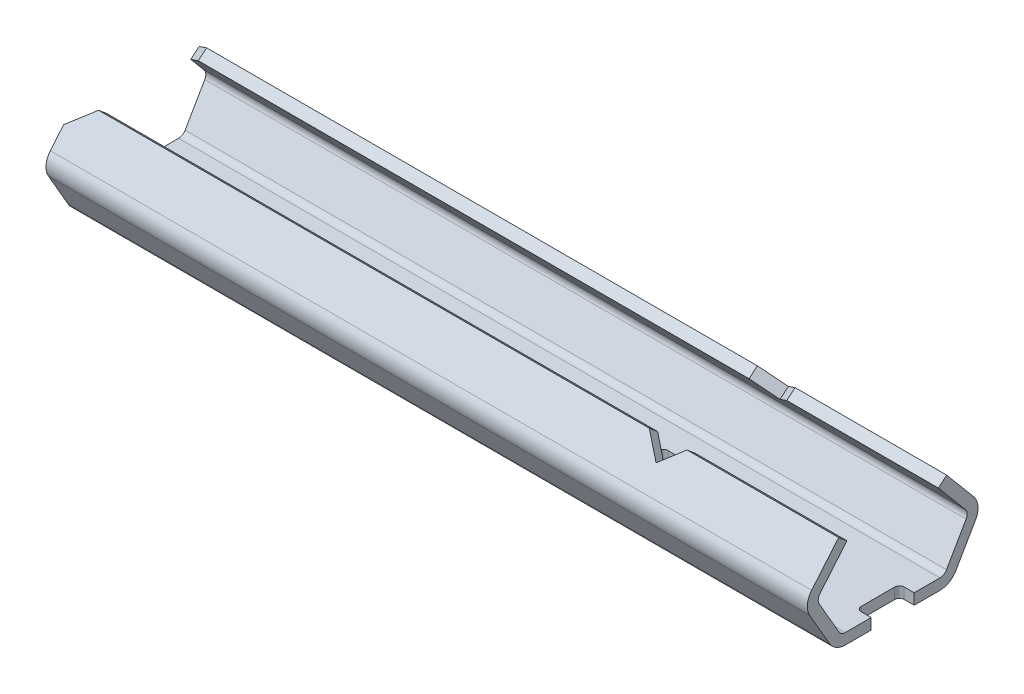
ISO-10303-21;
HEADER;
FILE_DESCRIPTION(('STEP AP214'),'2;1');
FILE_NAME('part.step','',(''),(''),'','','');
FILE_SCHEMA(('AUTOMOTIVE_DESIGN { 1 0 10303 214 1 1 1 1 }'));
ENDSEC;
DATA;
#1=APPLICATION_CONTEXT('core data for automotive mechanical design processes');
#2=APPLICATION_PROTOCOL_DEFINITION('international standard','automotive_design',2000,#1);
#3=PRODUCT_CONTEXT('',#1,'mechanical');
#4=PRODUCT('Part','Part','',(#3));
#5=PRODUCT_RELATED_PRODUCT_CATEGORY('part','',(#4));
#6=PRODUCT_DEFINITION_FORMATION('','',#4);
#7=PRODUCT_DEFINITION_CONTEXT('part definition',#1,'design');
#8=PRODUCT_DEFINITION('design','',#6,#7);
#9=PRODUCT_DEFINITION_SHAPE('','',#8);
#10=(LENGTH_UNIT() NAMED_UNIT(*) SI_UNIT(.MILLI.,.METRE.));
#11=(NAMED_UNIT(*) PLANE_ANGLE_UNIT() SI_UNIT($,.RADIAN.));
#12=(NAMED_UNIT(*) SI_UNIT($,.STERADIAN.) SOLID_ANGLE_UNIT());
#13=UNCERTAINTY_MEASURE_WITH_UNIT(LENGTH_MEASURE(1.E-05),#10,'distance_accuracy_value','');
#14=(GEOMETRIC_REPRESENTATION_CONTEXT(3) GLOBAL_UNCERTAINTY_ASSIGNED_CONTEXT((#13)) GLOBAL_UNIT_ASSIGNED_CONTEXT((#10,
#11,#12)) REPRESENTATION_CONTEXT('',''));
#15=CARTESIAN_POINT('',(0.,0.,0.));
#16=DIRECTION('',(0.,0.,1.));
#17=DIRECTION('',(1.,0.,0.));
#18=AXIS2_PLACEMENT_3D('',#15,#16,#17);
#19=CARTESIAN_POINT('',(228.77824845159,5.72178836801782,29.0670330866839));
#20=DIRECTION('',(0.,-0.642787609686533,-0.766044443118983));
#21=DIRECTION('',(0.,0.766044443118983,-0.642787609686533));
#22=AXIS2_PLACEMENT_3D('',#19,#20,#21);
#23=PLANE('',#22);
#24=DIRECTION('',(1.,0.,0.));
#25=VECTOR('',#24,1.);
#26=CARTESIAN_POINT('',(-76.0217515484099,9.61329413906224,25.8016720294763));
#27=LINE('',#26,#25);
#28=CARTESIAN_POINT('',(-10.4947664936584,9.61329413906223,25.8016720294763));
#29=VERTEX_POINT('',#28);
#30=CARTESIAN_POINT('',(5.79750095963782,9.61329413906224,25.8016720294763));
#31=VERTEX_POINT('',#30);
#32=EDGE_CURVE('E980',#29,#31,#27,.T.);
#33=ORIENTED_EDGE('',*,*,#32,.T.);
#34=DIRECTION('',(0.,-0.766044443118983,0.642787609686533));
#35=VECTOR('',#34,1.);
#36=CARTESIAN_POINT('',(5.79750095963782,5.72178836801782,29.0670330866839));
#37=LINE('',#36,#35);
#38=CARTESIAN_POINT('',(5.79750095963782,6.15776623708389,28.7012042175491));
#39=VERTEX_POINT('',#38);
#40=EDGE_CURVE('E1281',#31,#39,#37,.T.);
#41=ORIENTED_EDGE('',*,*,#40,.T.);
#42=DIRECTION('',(1.,0.,0.));
#43=VECTOR('',#42,1.);
#44=CARTESIAN_POINT('',(-228.433701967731,6.15776624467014,28.7012042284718));
#45=LINE('',#44,#43);
#46=CARTESIAN_POINT('',(-76.0217515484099,6.15776624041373,28.7012042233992));
#47=VERTEX_POINT('',#46);
#48=EDGE_CURVE('E938',#39,#47,#45,.F.);
#49=ORIENTED_EDGE('',*,*,#48,.T.);
#50=DIRECTION('',(0.,0.766044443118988,-0.642787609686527));
#51=VECTOR('',#50,1.);
#52=CARTESIAN_POINT('',(-76.0217515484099,6.15776623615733,28.7012042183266));
#53=LINE('',#52,#51);
#54=CARTESIAN_POINT('',(-76.0217515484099,7.86211654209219,27.2710845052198));
#55=VERTEX_POINT('',#54);
#56=EDGE_CURVE('E955',#47,#55,#53,.T.);
#57=ORIENTED_EDGE('',*,*,#56,.T.);
#58=DIRECTION('',(0.707106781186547,0.541675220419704,-0.454519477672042));
#59=VECTOR('',#58,1.);
#60=CARTESIAN_POINT('',(-76.0217515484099,7.8621165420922,27.2710845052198));
#61=LINE('',#60,#59);
#62=CARTESIAN_POINT('',(-73.7357515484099,9.61329413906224,25.8016720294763));
#63=VERTEX_POINT('',#62);
#64=EDGE_CURVE('E954',#55,#63,#61,.T.);
#65=ORIENTED_EDGE('',*,*,#64,.T.);
#66=DIRECTION('',(1.,0.,0.));
#67=VECTOR('',#66,1.);
#68=CARTESIAN_POINT('',(-76.0217515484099,9.61329413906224,25.8016720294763));
#69=LINE('',#68,#67);
#70=CARTESIAN_POINT('',(-14.5487366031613,9.61329413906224,25.8016720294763));
#71=VERTEX_POINT('',#70);
#72=EDGE_CURVE('E1012',#63,#71,#69,.T.);
#73=ORIENTED_EDGE('',*,*,#72,.T.);
#74=DIRECTION('',(0.70710678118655,-0.541675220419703,0.454519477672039));
#75=VECTOR('',#74,1.);
#76=CARTESIAN_POINT('',(-14.5487366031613,9.61329413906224,25.8016720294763));
#77=LINE('',#76,#75);
#78=CARTESIAN_POINT('',(-12.5217515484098,8.06053350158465,27.1045929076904));
#79=VERTEX_POINT('',#78);
#80=EDGE_CURVE('E1010',#71,#79,#77,.T.);
#81=ORIENTED_EDGE('',*,*,#80,.T.);
#82=DIRECTION('',(0.707106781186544,0.541675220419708,-0.454519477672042));
#83=VECTOR('',#82,1.);
#84=CARTESIAN_POINT('',(-12.5217515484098,8.06053350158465,27.1045929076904));
#85=LINE('',#84,#83);
#86=EDGE_CURVE('E988',#79,#29,#85,.T.);
#87=ORIENTED_EDGE('',*,*,#86,.T.);
#88=EDGE_LOOP('',(#33,#41,#49,#57,#65,#73,#81,#87));
#89=FACE_BOUND('',#88,.T.);
#90=ADVANCED_FACE('F34',(#89),#23,.T.);
#91=CARTESIAN_POINT('',(228.77824845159,5.72178836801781,12.7106924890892));
#92=DIRECTION('',(0.,-0.642787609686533,0.766044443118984));
#93=DIRECTION('',(0.,-0.766044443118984,-0.642787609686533));
#94=AXIS2_PLACEMENT_3D('',#91,#92,#93);
#95=PLANE('',#94);
#96=DIRECTION('',(-1.,0.,0.));
#97=VECTOR('',#96,1.);
#98=CARTESIAN_POINT('',(381.190198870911,6.15776623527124,13.0765213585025));
#99=LINE('',#98,#97);
#100=CARTESIAN_POINT('',(-76.0217515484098,6.15776623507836,13.0765213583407));
#101=VERTEX_POINT('',#100);
#102=CARTESIAN_POINT('',(5.79750095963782,6.15776623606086,13.0765213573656));
#103=VERTEX_POINT('',#102);
#104=EDGE_CURVE('E943',#101,#103,#99,.F.);
#105=ORIENTED_EDGE('',*,*,#104,.T.);
#106=DIRECTION('',(0.,0.766044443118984,0.642787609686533));
#107=VECTOR('',#106,1.);
#108=CARTESIAN_POINT('',(5.79750095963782,5.72178836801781,12.7106924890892));
#109=LINE('',#108,#107);
#110=CARTESIAN_POINT('',(5.79750095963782,9.61329413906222,15.9760535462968));
#111=VERTEX_POINT('',#110);
#112=EDGE_CURVE('E1242',#103,#111,#109,.T.);
#113=ORIENTED_EDGE('',*,*,#112,.T.);
#114=DIRECTION('',(1.,0.,0.));
#115=VECTOR('',#114,1.);
#116=CARTESIAN_POINT('',(228.77824845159,9.61329413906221,15.9760535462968));
#117=LINE('',#116,#115);
#118=CARTESIAN_POINT('',(-10.4947664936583,9.61329413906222,15.9760535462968));
#119=VERTEX_POINT('',#118);
#120=EDGE_CURVE('E37',#111,#119,#117,.F.);
#121=ORIENTED_EDGE('',*,*,#120,.T.);
#122=DIRECTION('',(0.707106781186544,0.541675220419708,0.454519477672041));
#123=VECTOR('',#122,1.);
#124=CARTESIAN_POINT('',(-12.5217515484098,8.06053350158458,14.6731326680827));
#125=LINE('',#124,#123);
#126=CARTESIAN_POINT('',(-12.5217515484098,8.06053350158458,14.6731326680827));
#127=VERTEX_POINT('',#126);
#128=EDGE_CURVE('E971',#127,#119,#125,.T.);
#129=ORIENTED_EDGE('',*,*,#128,.F.);
#130=DIRECTION('',(0.70710678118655,-0.541675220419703,-0.454519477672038));
#131=VECTOR('',#130,1.);
#132=CARTESIAN_POINT('',(-14.5487366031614,9.61329413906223,15.9760535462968));
#133=LINE('',#132,#131);
#134=CARTESIAN_POINT('',(-14.5487366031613,9.61329413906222,15.9760535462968));
#135=VERTEX_POINT('',#134);
#136=EDGE_CURVE('E969',#135,#127,#133,.T.);
#137=ORIENTED_EDGE('',*,*,#136,.F.);
#138=DIRECTION('',(1.,0.,0.));
#139=VECTOR('',#138,1.);
#140=CARTESIAN_POINT('',(228.77824845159,9.61329413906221,15.9760535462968));
#141=LINE('',#140,#139);
#142=CARTESIAN_POINT('',(-73.7357515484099,9.61329413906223,15.9760535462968));
#143=VERTEX_POINT('',#142);
#144=EDGE_CURVE('E963',#135,#143,#141,.F.);
#145=ORIENTED_EDGE('',*,*,#144,.T.);
#146=DIRECTION('',(-0.707106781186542,-0.54167522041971,-0.454519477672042));
#147=VECTOR('',#146,1.);
#148=CARTESIAN_POINT('',(-73.7357515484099,9.61329413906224,15.9760535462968));
#149=LINE('',#148,#147);
#150=CARTESIAN_POINT('',(-76.0217515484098,7.86211654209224,14.5066410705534));
#151=VERTEX_POINT('',#150);
#152=EDGE_CURVE('E958',#143,#151,#149,.T.);
#153=ORIENTED_EDGE('',*,*,#152,.T.);
#154=DIRECTION('',(0.,-0.766044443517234,-0.642787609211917));
#155=VECTOR('',#154,1.);
#156=CARTESIAN_POINT('',(-76.0217515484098,7.86211654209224,14.5066410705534));
#157=LINE('',#156,#155);
#158=EDGE_CURVE('E935',#151,#101,#157,.T.);
#159=ORIENTED_EDGE('',*,*,#158,.T.);
#160=EDGE_LOOP('',(#105,#113,#121,#129,#137,#145,#153,#159));
#161=FACE_BOUND('',#160,.T.);
#162=ADVANCED_FACE('F1239',(#161),#95,.T.);
#163=CARTESIAN_POINT('',(-76.0217515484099,10.36432718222,26.6967183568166));
#164=DIRECTION('',(0.,-0.766044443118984,0.642787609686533));
#165=DIRECTION('',(0.,-0.642787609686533,-0.766044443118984));
#166=AXIS2_PLACEMENT_3D('',#163,#164,#165);
#167=PLANE('',#166);
#168=DIRECTION('',(0.,0.642787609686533,0.766044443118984));
#169=VECTOR('',#168,1.);
#170=CARTESIAN_POINT('',(5.79750095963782,10.36432718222,26.6967183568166));
#171=LINE('',#170,#169);
#172=CARTESIAN_POINT('',(5.79750095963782,10.36432718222,26.6967183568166));
#173=VERTEX_POINT('',#172);
#174=EDGE_CURVE('E1287',#31,#173,#171,.T.);
#175=ORIENTED_EDGE('',*,*,#174,.F.);
#176=ORIENTED_EDGE('',*,*,#32,.F.);
#177=DIRECTION('',(0.,-0.642787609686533,-0.766044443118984));
#178=VECTOR('',#177,1.);
#179=CARTESIAN_POINT('',(-10.4947664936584,10.36432718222,26.6967183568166));
#180=LINE('',#179,#178);
#181=CARTESIAN_POINT('',(-10.4947664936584,10.36432718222,26.6967183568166));
#182=VERTEX_POINT('',#181);
#183=EDGE_CURVE('E983',#182,#29,#180,.T.);
#184=ORIENTED_EDGE('',*,*,#183,.F.);
#185=DIRECTION('',(1.,0.,0.));
#186=VECTOR('',#185,1.);
#187=CARTESIAN_POINT('',(228.77824845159,10.36432718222,26.6967183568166));
#188=LINE('',#187,#186);
#189=EDGE_CURVE('E927',#182,#173,#188,.T.);
#190=ORIENTED_EDGE('',*,*,#189,.T.);
#191=EDGE_LOOP('',(#175,#176,#184,#190));
#192=FACE_BOUND('',#191,.T.);
#193=ADVANCED_FACE('F1278',(#192),#167,.F.);
#194=CARTESIAN_POINT('',(228.77824845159,10.36432718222,15.0810072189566));
#195=DIRECTION('',(0.,-0.766044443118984,-0.642787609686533));
#196=DIRECTION('',(0.,0.642787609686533,-0.766044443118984));
#197=AXIS2_PLACEMENT_3D('',#194,#195,#196);
#198=PLANE('',#197);
#199=DIRECTION('',(0.,-0.642787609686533,0.766044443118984));
#200=VECTOR('',#199,1.);
#201=CARTESIAN_POINT('',(5.79750095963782,10.36432718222,15.0810072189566));
#202=LINE('',#201,#200);
#203=CARTESIAN_POINT('',(5.79750095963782,10.36432718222,15.0810072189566));
#204=VERTEX_POINT('',#203);
#205=EDGE_CURVE('E1248',#204,#111,#202,.T.);
#206=ORIENTED_EDGE('',*,*,#205,.F.);
#207=DIRECTION('',(1.,0.,0.));
#208=VECTOR('',#207,1.);
#209=CARTESIAN_POINT('',(228.77824845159,10.36432718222,15.0810072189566));
#210=LINE('',#209,#208);
#211=CARTESIAN_POINT('',(-10.4947664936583,10.3643271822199,15.0810072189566));
#212=VERTEX_POINT('',#211);
#213=EDGE_CURVE('E924',#204,#212,#210,.F.);
#214=ORIENTED_EDGE('',*,*,#213,.T.);
#215=DIRECTION('',(0.,0.642787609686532,-0.766044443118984));
#216=VECTOR('',#215,1.);
#217=CARTESIAN_POINT('',(-10.4947664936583,9.61329413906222,15.9760535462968));
#218=LINE('',#217,#216);
#219=EDGE_CURVE('E976',#119,#212,#218,.T.);
#220=ORIENTED_EDGE('',*,*,#219,.F.);
#221=ORIENTED_EDGE('',*,*,#120,.F.);
#222=EDGE_LOOP('',(#206,#214,#220,#221));
#223=FACE_BOUND('',#222,.T.);
#224=ADVANCED_FACE('F1246',(#223),#198,.F.);
#225=CARTESIAN_POINT('',(-228.433701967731,5.63530846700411,28.0785632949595));
#226=DIRECTION('',(1.,0.,0.));
#227=DIRECTION('',(0.,0.,-1.));
#228=AXIS2_PLACEMENT_3D('',#225,#226,#227);
#229=CYLINDRICAL_SURFACE('',#228,0.812800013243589);
#230=CARTESIAN_POINT('',(5.79750095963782,5.63530846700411,28.0785632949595));
#231=DIRECTION('',(1.,0.,0.));
#232=DIRECTION('',(0.,0.,-1.));
#233=AXIS2_PLACEMENT_3D('',#230,#231,#232);
#234=CIRCLE('',#233,0.812800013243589);
#235=CARTESIAN_POINT('',(5.79750095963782,5.22890845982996,28.7824687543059));
#236=VERTEX_POINT('',#235);
#237=EDGE_CURVE('E1324',#236,#39,#234,.F.);
#238=ORIENTED_EDGE('',*,*,#237,.F.);
#239=DIRECTION('',(1.,0.,0.));
#240=VECTOR('',#239,1.);
#241=CARTESIAN_POINT('',(-76.0217515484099,5.2289084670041,28.7824687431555));
#242=LINE('',#241,#240);
#243=CARTESIAN_POINT('',(-76.0217515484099,5.22890846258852,28.7824687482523));
#244=VERTEX_POINT('',#243);
#245=EDGE_CURVE('E1179',#244,#236,#242,.T.);
#246=ORIENTED_EDGE('',*,*,#245,.F.);
#247=CARTESIAN_POINT('',(-76.0217515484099,5.63530846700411,28.0785632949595));
#248=DIRECTION('',(1.,0.,0.));
#249=DIRECTION('',(0.,0.,-1.));
#250=AXIS2_PLACEMENT_3D('',#247,#248,#249);
#251=CIRCLE('',#250,0.812800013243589);
#252=EDGE_CURVE('E925',#244,#47,#251,.F.);
#253=ORIENTED_EDGE('',*,*,#252,.T.);
#254=ORIENTED_EDGE('',*,*,#48,.F.);
#255=EDGE_LOOP('',(#238,#246,#253,#254));
#256=FACE_BOUND('',#255,.T.);
#257=ADVANCED_FACE('F1445',(#256),#229,.F.);
#258=CARTESIAN_POINT('',(381.190198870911,5.63530846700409,13.6991622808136));
#259=DIRECTION('',(-1.,0.,0.));
#260=DIRECTION('',(0.,0.,1.));
#261=AXIS2_PLACEMENT_3D('',#258,#259,#260);
#262=CYLINDRICAL_SURFACE('',#261,0.81279999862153);
#263=CARTESIAN_POINT('',(5.79750095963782,5.63530846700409,13.6991622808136));
#264=DIRECTION('',(1.,0.,0.));
#265=DIRECTION('',(0.,0.,-1.));
#266=AXIS2_PLACEMENT_3D('',#263,#264,#265);
#267=CIRCLE('',#266,0.81279999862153);
#268=CARTESIAN_POINT('',(5.79750095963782,5.22890846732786,12.9952568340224));
#269=VERTEX_POINT('',#268);
#270=EDGE_CURVE('E1356',#103,#269,#267,.F.);
#271=ORIENTED_EDGE('',*,*,#270,.F.);
#272=ORIENTED_EDGE('',*,*,#104,.F.);
#273=CARTESIAN_POINT('',(-76.0217515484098,5.63530846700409,13.6991622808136));
#274=DIRECTION('',(-1.,0.,0.));
#275=DIRECTION('',(0.,0.,1.));
#276=AXIS2_PLACEMENT_3D('',#273,#274,#275);
#277=CIRCLE('',#276,0.81279999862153);
#278=CARTESIAN_POINT('',(-76.0217515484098,5.22890846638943,12.9952568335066));
#279=VERTEX_POINT('',#278);
#280=EDGE_CURVE('E921',#101,#279,#277,.T.);
#281=ORIENTED_EDGE('',*,*,#280,.T.);
#282=DIRECTION('',(1.,0.,0.));
#283=VECTOR('',#282,1.);
#284=CARTESIAN_POINT('',(228.77824845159,5.22890846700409,12.9952568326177));
#285=LINE('',#284,#283);
#286=EDGE_CURVE('E1175',#279,#269,#285,.T.);
#287=ORIENTED_EDGE('',*,*,#286,.T.);
#288=EDGE_LOOP('',(#271,#272,#281,#287));
#289=FACE_BOUND('',#288,.T.);
#290=ADVANCED_FACE('F1355',(#289),#262,.F.);
#291=CARTESIAN_POINT('',(228.77824845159,6.47282141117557,29.9620794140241));
#292=DIRECTION('',(0.,-0.642787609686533,-0.766044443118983));
#293=DIRECTION('',(0.,0.766044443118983,-0.642787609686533));
#294=AXIS2_PLACEMENT_3D('',#291,#292,#293);
#295=PLANE('',#294);
#296=DIRECTION('',(0.,-0.766044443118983,0.642787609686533));
#297=VECTOR('',#296,1.);
#298=CARTESIAN_POINT('',(5.79750095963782,6.47282141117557,29.9620794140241));
#299=LINE('',#298,#297);
#300=CARTESIAN_POINT('',(5.79750095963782,6.90879928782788,29.596250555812));
#301=VERTEX_POINT('',#300);
#302=EDGE_CURVE('E1309',#173,#301,#299,.T.);
#303=ORIENTED_EDGE('',*,*,#302,.F.);
#304=ORIENTED_EDGE('',*,*,#189,.F.);
#305=DIRECTION('',(0.707106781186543,0.541675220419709,-0.454519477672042));
#306=VECTOR('',#305,1.);
#307=CARTESIAN_POINT('',(-12.5217515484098,8.8115665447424,27.9996392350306));
#308=LINE('',#307,#306);
#309=CARTESIAN_POINT('',(-12.5217515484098,8.81156654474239,27.9996392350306));
#310=VERTEX_POINT('',#309);
#311=EDGE_CURVE('E997',#310,#182,#308,.T.);
#312=ORIENTED_EDGE('',*,*,#311,.F.);
#313=DIRECTION('',(0.707106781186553,-0.541675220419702,0.454519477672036));
#314=VECTOR('',#313,1.);
#315=CARTESIAN_POINT('',(-14.5487366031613,10.36432718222,26.6967183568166));
#316=LINE('',#315,#314);
#317=CARTESIAN_POINT('',(-14.5487366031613,10.36432718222,26.6967183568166));
#318=VERTEX_POINT('',#317);
#319=EDGE_CURVE('E1002',#318,#310,#316,.T.);
#320=ORIENTED_EDGE('',*,*,#319,.F.);
#321=DIRECTION('',(1.,0.,0.));
#322=VECTOR('',#321,1.);
#323=CARTESIAN_POINT('',(228.77824845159,10.36432718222,26.6967183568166));
#324=LINE('',#323,#322);
#325=CARTESIAN_POINT('',(-73.7357515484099,10.36432718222,26.6967183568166));
#326=VERTEX_POINT('',#325);
#327=EDGE_CURVE('E947',#326,#318,#324,.T.);
#328=ORIENTED_EDGE('',*,*,#327,.F.);
#329=DIRECTION('',(0.707106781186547,0.541675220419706,-0.45451947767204));
#330=VECTOR('',#329,1.);
#331=CARTESIAN_POINT('',(-76.0217515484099,8.61314958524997,28.16613083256));
#332=LINE('',#331,#330);
#333=CARTESIAN_POINT('',(-76.0217515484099,8.61314958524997,28.16613083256));
#334=VERTEX_POINT('',#333);
#335=EDGE_CURVE('E944',#334,#326,#332,.T.);
#336=ORIENTED_EDGE('',*,*,#335,.F.);
#337=DIRECTION('',(0.,0.766044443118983,-0.642787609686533));
#338=VECTOR('',#337,1.);
#339=CARTESIAN_POINT('',(-76.0217515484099,6.47282141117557,29.9620794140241));
#340=LINE('',#339,#338);
#341=CARTESIAN_POINT('',(-76.0217515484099,6.90879928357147,29.5962505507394));
#342=VERTEX_POINT('',#341);
#343=EDGE_CURVE('E948',#342,#334,#340,.T.);
#344=ORIENTED_EDGE('',*,*,#343,.F.);
#345=DIRECTION('',(1.,0.,0.));
#346=VECTOR('',#345,1.);
#347=CARTESIAN_POINT('',(-228.433701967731,6.90879928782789,29.596250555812));
#348=LINE('',#347,#346);
#349=EDGE_CURVE('E920',#301,#342,#348,.F.);
#350=ORIENTED_EDGE('',*,*,#349,.F.);
#351=EDGE_LOOP('',(#303,#304,#312,#320,#328,#336,#344,#350));
#352=FACE_BOUND('',#351,.T.);
#353=ADVANCED_FACE('F1294',(#352),#295,.F.);
#354=CARTESIAN_POINT('',(228.77824845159,6.47282141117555,11.815646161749));
#355=DIRECTION('',(0.,-0.642787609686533,0.766044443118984));
#356=DIRECTION('',(0.,-0.766044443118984,-0.642787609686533));
#357=AXIS2_PLACEMENT_3D('',#354,#355,#356);
#358=PLANE('',#357);
#359=DIRECTION('',(0.,0.766044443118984,0.642787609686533));
#360=VECTOR('',#359,1.);
#361=CARTESIAN_POINT('',(5.79750095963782,6.47282141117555,11.815646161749));
#362=LINE('',#361,#360);
#363=CARTESIAN_POINT('',(5.79750095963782,6.908799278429,12.1814750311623));
#364=VERTEX_POINT('',#363);
#365=EDGE_CURVE('E1253',#364,#204,#362,.T.);
#366=ORIENTED_EDGE('',*,*,#365,.F.);
#367=DIRECTION('',(-1.,0.,0.));
#368=VECTOR('',#367,1.);
#369=CARTESIAN_POINT('',(381.190198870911,6.908799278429,12.1814750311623));
#370=LINE('',#369,#368);
#371=CARTESIAN_POINT('',(-76.0217515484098,6.90879927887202,12.1814750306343));
#372=VERTEX_POINT('',#371);
#373=EDGE_CURVE('E916',#372,#364,#370,.F.);
#374=ORIENTED_EDGE('',*,*,#373,.F.);
#375=DIRECTION('',(0.,-0.766044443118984,-0.642787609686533));
#376=VECTOR('',#375,1.);
#377=CARTESIAN_POINT('',(-76.0217515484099,6.47282141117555,11.815646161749));
#378=LINE('',#377,#376);
#379=CARTESIAN_POINT('',(-76.0217515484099,8.61314958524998,13.6115947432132));
#380=VERTEX_POINT('',#379);
#381=EDGE_CURVE('E1182',#380,#372,#378,.T.);
#382=ORIENTED_EDGE('',*,*,#381,.F.);
#383=DIRECTION('',(-0.707106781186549,-0.541675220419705,-0.454519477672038));
#384=VECTOR('',#383,1.);
#385=CARTESIAN_POINT('',(-73.7357515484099,10.36432718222,15.0810072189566));
#386=LINE('',#385,#384);
#387=CARTESIAN_POINT('',(-73.7357515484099,10.36432718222,15.0810072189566));
#388=VERTEX_POINT('',#387);
#389=EDGE_CURVE('E1185',#388,#380,#386,.T.);
#390=ORIENTED_EDGE('',*,*,#389,.F.);
#391=DIRECTION('',(1.,0.,0.));
#392=VECTOR('',#391,1.);
#393=CARTESIAN_POINT('',(228.77824845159,10.36432718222,15.0810072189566));
#394=LINE('',#393,#392);
#395=CARTESIAN_POINT('',(-14.5487366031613,10.36432718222,15.0810072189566));
#396=VERTEX_POINT('',#395);
#397=EDGE_CURVE('E1205',#396,#388,#394,.F.);
#398=ORIENTED_EDGE('',*,*,#397,.F.);
#399=DIRECTION('',(-0.707106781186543,0.541675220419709,0.454519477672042));
#400=VECTOR('',#399,1.);
#401=CARTESIAN_POINT('',(-12.5217515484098,8.81156654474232,13.7780863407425));
#402=LINE('',#401,#400);
#403=CARTESIAN_POINT('',(-12.5217515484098,8.81156654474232,13.7780863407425));
#404=VERTEX_POINT('',#403);
#405=EDGE_CURVE('E1214',#404,#396,#402,.T.);
#406=ORIENTED_EDGE('',*,*,#405,.F.);
#407=DIRECTION('',(-0.707106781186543,-0.541675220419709,-0.454519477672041));
#408=VECTOR('',#407,1.);
#409=CARTESIAN_POINT('',(-10.4947664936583,10.36432718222,15.0810072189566));
#410=LINE('',#409,#408);
#411=EDGE_CURVE('E929',#212,#404,#410,.T.);
#412=ORIENTED_EDGE('',*,*,#411,.F.);
#413=ORIENTED_EDGE('',*,*,#213,.F.);
#414=EDGE_LOOP('',(#366,#374,#382,#390,#398,#406,#412,#413));
#415=FACE_BOUND('',#414,.T.);
#416=ADVANCED_FACE('F1251',(#415),#358,.F.);
#417=CARTESIAN_POINT('',(-76.0217515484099,5.72178836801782,29.0670330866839));
#418=DIRECTION('',(0.,0.500000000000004,-0.866025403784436));
#419=DIRECTION('',(0.,0.866025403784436,0.500000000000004));
#420=AXIS2_PLACEMENT_3D('',#417,#418,#419);
#421=PLANE('',#420);
#422=ORIENTED_EDGE('',*,*,#245,.T.);
#423=DIRECTION('',(0.,-0.866025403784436,-0.500000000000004));
#424=VECTOR('',#423,1.);
#425=CARTESIAN_POINT('',(5.79750095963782,5.72178836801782,29.0670330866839));
#426=LINE('',#425,#424);
#427=CARTESIAN_POINT('',(5.79750095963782,1.57479999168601,26.6727682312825));
#428=VERTEX_POINT('',#427);
#429=EDGE_CURVE('E1325',#236,#428,#426,.T.);
#430=ORIENTED_EDGE('',*,*,#429,.T.);
#431=DIRECTION('',(1.,0.,0.));
#432=VECTOR('',#431,1.);
#433=CARTESIAN_POINT('',(-228.42716658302,1.57479999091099,26.6727682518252));
#434=LINE('',#433,#432);
#435=CARTESIAN_POINT('',(-76.0217515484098,1.57479999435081,26.6727682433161));
#436=VERTEX_POINT('',#435);
#437=EDGE_CURVE('E1167',#428,#436,#434,.F.);
#438=ORIENTED_EDGE('',*,*,#437,.T.);
#439=DIRECTION('',(0.,0.866025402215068,0.50000000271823));
#440=VECTOR('',#439,1.);
#441=CARTESIAN_POINT('',(-76.0217515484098,1.5748,26.6727682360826));
#442=LINE('',#441,#440);
#443=EDGE_CURVE('E1178',#436,#244,#442,.T.);
#444=ORIENTED_EDGE('',*,*,#443,.T.);
#445=EDGE_LOOP('',(#422,#430,#438,#444));
#446=FACE_BOUND('',#445,.T.);
#447=ADVANCED_FACE('F1436',(#446),#421,.T.);
#448=CARTESIAN_POINT('',(228.77824845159,1.1684,15.3395924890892));
#449=DIRECTION('',(0.,-0.500000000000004,-0.866025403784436));
#450=DIRECTION('',(0.,0.866025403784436,-0.500000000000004));
#451=AXIS2_PLACEMENT_3D('',#448,#449,#450);
#452=PLANE('',#451);
#453=DIRECTION('',(0.,-0.866025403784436,0.500000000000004));
#454=VECTOR('',#453,1.);
#455=CARTESIAN_POINT('',(5.79750095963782,1.1684,15.3395924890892));
#456=LINE('',#455,#454);
#457=CARTESIAN_POINT('',(5.79750095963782,1.57480000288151,15.1049573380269));
#458=VERTEX_POINT('',#457);
#459=EDGE_CURVE('E1351',#269,#458,#456,.T.);
#460=ORIENTED_EDGE('',*,*,#459,.F.);
#461=ORIENTED_EDGE('',*,*,#286,.F.);
#462=DIRECTION('',(0.,-0.866025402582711,0.500000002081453));
#463=VECTOR('',#462,1.);
#464=CARTESIAN_POINT('',(-76.0217515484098,5.22890846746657,12.9952568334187));
#465=LINE('',#464,#463);
#466=CARTESIAN_POINT('',(-76.0217515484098,1.57480000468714,15.1049573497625));
#467=VERTEX_POINT('',#466);
#468=EDGE_CURVE('E917',#279,#467,#465,.T.);
#469=ORIENTED_EDGE('',*,*,#468,.T.);
#470=DIRECTION('',(-1.,0.,0.));
#471=VECTOR('',#470,1.);
#472=CARTESIAN_POINT('',(381.1836634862,1.57480000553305,15.1049573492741));
#473=LINE('',#472,#471);
#474=EDGE_CURVE('E1164',#467,#458,#473,.F.);
#475=ORIENTED_EDGE('',*,*,#474,.T.);
#476=EDGE_LOOP('',(#460,#461,#469,#475));
#477=FACE_BOUND('',#476,.T.);
#478=ADVANCED_FACE('F1350',(#477),#452,.F.);
#479=CARTESIAN_POINT('',(-228.433701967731,5.63530846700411,28.0785632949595));
#480=DIRECTION('',(1.,0.,0.));
#481=DIRECTION('',(0.,0.,-1.));
#482=AXIS2_PLACEMENT_3D('',#479,#480,#481);
#483=CYLINDRICAL_SURFACE('',#482,1.98120001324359);
#484=DIRECTION('',(1.,0.,0.));
#485=VECTOR('',#484,1.);
#486=CARTESIAN_POINT('',(-76.0217515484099,4.6447084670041,29.7943328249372));
#487=LINE('',#486,#485);
#488=CARTESIAN_POINT('',(-76.0217515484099,4.6447084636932,29.7943328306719));
#489=VERTEX_POINT('',#488);
#490=CARTESIAN_POINT('',(5.79750095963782,4.6447084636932,29.7943328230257));
#491=VERTEX_POINT('',#490);
#492=EDGE_CURVE('E913',#489,#491,#487,.T.);
#493=ORIENTED_EDGE('',*,*,#492,.T.);
#494=CARTESIAN_POINT('',(5.79750095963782,5.63530846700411,28.0785632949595));
#495=DIRECTION('',(1.,0.,0.));
#496=DIRECTION('',(0.,0.,-1.));
#497=AXIS2_PLACEMENT_3D('',#494,#495,#496);
#498=CIRCLE('',#497,1.98120001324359);
#499=EDGE_CURVE('E1314',#491,#301,#498,.F.);
#500=ORIENTED_EDGE('',*,*,#499,.T.);
#501=ORIENTED_EDGE('',*,*,#349,.T.);
#502=CARTESIAN_POINT('',(-76.0217515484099,5.63530846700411,28.0785632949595));
#503=DIRECTION('',(1.,0.,0.));
#504=DIRECTION('',(0.,0.,-1.));
#505=AXIS2_PLACEMENT_3D('',#502,#503,#504);
#506=CIRCLE('',#505,1.98120001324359);
#507=EDGE_CURVE('E918',#342,#489,#506,.T.);
#508=ORIENTED_EDGE('',*,*,#507,.T.);
#509=EDGE_LOOP('',(#493,#500,#501,#508));
#510=FACE_BOUND('',#509,.T.);
#511=ADVANCED_FACE('F1312',(#510),#483,.T.);
#512=CARTESIAN_POINT('',(381.190198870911,5.63530846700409,13.6991622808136));
#513=DIRECTION('',(-1.,0.,0.));
#514=DIRECTION('',(0.,0.,1.));
#515=AXIS2_PLACEMENT_3D('',#512,#513,#514);
#516=CYLINDRICAL_SURFACE('',#515,1.98119999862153);
#517=ORIENTED_EDGE('',*,*,#373,.T.);
#518=CARTESIAN_POINT('',(5.79750095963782,5.63530846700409,13.6991622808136));
#519=DIRECTION('',(1.,0.,0.));
#520=DIRECTION('',(0.,0.,-1.));
#521=AXIS2_PLACEMENT_3D('',#518,#519,#520);
#522=CIRCLE('',#521,1.98119999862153);
#523=CARTESIAN_POINT('',(5.79750095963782,4.6447084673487,11.983392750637));
#524=VERTEX_POINT('',#523);
#525=EDGE_CURVE('E1363',#364,#524,#522,.F.);
#526=ORIENTED_EDGE('',*,*,#525,.T.);
#527=DIRECTION('',(1.,0.,0.));
#528=VECTOR('',#527,1.);
#529=CARTESIAN_POINT('',(228.77824845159,4.64470846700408,11.9833927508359));
#530=LINE('',#529,#528);
#531=CARTESIAN_POINT('',(-76.0217515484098,4.6447084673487,11.9833927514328));
#532=VERTEX_POINT('',#531);
#533=EDGE_CURVE('E905',#532,#524,#530,.T.);
#534=ORIENTED_EDGE('',*,*,#533,.F.);
#535=CARTESIAN_POINT('',(-76.0217515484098,5.63530846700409,13.6991622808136));
#536=DIRECTION('',(-1.,0.,0.));
#537=DIRECTION('',(0.,0.,1.));
#538=AXIS2_PLACEMENT_3D('',#535,#536,#537);
#539=CIRCLE('',#538,1.98119999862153);
#540=EDGE_CURVE('E914',#532,#372,#539,.F.);
#541=ORIENTED_EDGE('',*,*,#540,.T.);
#542=EDGE_LOOP('',(#517,#526,#534,#541));
#543=FACE_BOUND('',#542,.T.);
#544=ADVANCED_FACE('F1361',(#543),#516,.T.);
#545=CARTESIAN_POINT('',(-228.42716658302,1.9812,25.9688627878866));
#546=DIRECTION('',(1.,0.,0.));
#547=DIRECTION('',(0.,0.,-1.));
#548=AXIS2_PLACEMENT_3D('',#545,#546,#547);
#549=CYLINDRICAL_SURFACE('',#548,0.812800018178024);
#550=CARTESIAN_POINT('',(5.79750095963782,1.9812,25.9688627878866));
#551=DIRECTION('',(1.,0.,0.));
#552=DIRECTION('',(0.,0.,-1.));
#553=AXIS2_PLACEMENT_3D('',#550,#551,#552);
#554=CIRCLE('',#553,0.812800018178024);
#555=CARTESIAN_POINT('',(5.79750095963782,1.16839998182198,25.9688627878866));
#556=VERTEX_POINT('',#555);
#557=EDGE_CURVE('E1048',#556,#428,#554,.F.);
#558=ORIENTED_EDGE('',*,*,#557,.F.);
#559=DIRECTION('',(1.,0.,0.));
#560=VECTOR('',#559,1.);
#561=CARTESIAN_POINT('',(-76.0217515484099,1.1684,25.9688627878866));
#562=LINE('',#561,#560);
#563=CARTESIAN_POINT('',(-76.0217515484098,1.16839999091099,25.9688627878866));
#564=VERTEX_POINT('',#563);
#565=EDGE_CURVE('E902',#564,#556,#562,.T.);
#566=ORIENTED_EDGE('',*,*,#565,.F.);
#567=CARTESIAN_POINT('',(-76.0217515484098,1.9812,25.9688627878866));
#568=DIRECTION('',(1.,0.,0.));
#569=DIRECTION('',(0.,0.,-1.));
#570=AXIS2_PLACEMENT_3D('',#567,#568,#569);
#571=CIRCLE('',#570,0.812800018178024);
#572=EDGE_CURVE('E910',#564,#436,#571,.F.);
#573=ORIENTED_EDGE('',*,*,#572,.T.);
#574=ORIENTED_EDGE('',*,*,#437,.F.);
#575=EDGE_LOOP('',(#558,#566,#573,#574));
#576=FACE_BOUND('',#575,.T.);
#577=ADVANCED_FACE('F1334',(#576),#549,.F.);
#578=CARTESIAN_POINT('',(381.1836634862,1.9812,15.8088627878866));
#579=DIRECTION('',(-1.,0.,0.));
#580=DIRECTION('',(0.,0.,1.));
#581=AXIS2_PLACEMENT_3D('',#578,#579,#580);
#582=CYLINDRICAL_SURFACE('',#581,0.812799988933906);
#583=CARTESIAN_POINT('',(5.79750095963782,1.9812,15.8088627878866));
#584=DIRECTION('',(1.,0.,0.));
#585=DIRECTION('',(0.,0.,-1.));
#586=AXIS2_PLACEMENT_3D('',#583,#584,#585);
#587=CIRCLE('',#586,0.812799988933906);
#588=CARTESIAN_POINT('',(5.79750095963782,1.16840001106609,15.8088627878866));
#589=VERTEX_POINT('',#588);
#590=EDGE_CURVE('E1347',#458,#589,#587,.F.);
#591=ORIENTED_EDGE('',*,*,#590,.F.);
#592=ORIENTED_EDGE('',*,*,#474,.F.);
#593=CARTESIAN_POINT('',(-76.0217515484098,1.9812,15.8088627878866));
#594=DIRECTION('',(-1.,0.,0.));
#595=DIRECTION('',(0.,0.,1.));
#596=AXIS2_PLACEMENT_3D('',#593,#594,#595);
#597=CIRCLE('',#596,0.812799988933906);
#598=CARTESIAN_POINT('',(-76.0217515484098,1.16840000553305,15.8088627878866));
#599=VERTEX_POINT('',#598);
#600=EDGE_CURVE('E906',#467,#599,#597,.T.);
#601=ORIENTED_EDGE('',*,*,#600,.T.);
#602=DIRECTION('',(1.,0.,0.));
#603=VECTOR('',#602,1.);
#604=CARTESIAN_POINT('',(-76.0217515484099,1.1684,15.8088627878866));
#605=LINE('',#604,#603);
#606=EDGE_CURVE('E900',#589,#599,#605,.F.);
#607=ORIENTED_EDGE('',*,*,#606,.F.);
#608=EDGE_LOOP('',(#591,#592,#601,#607));
#609=FACE_BOUND('',#608,.T.);
#610=ADVANCED_FACE('F1346',(#609),#582,.F.);
#611=CARTESIAN_POINT('',(-76.0217515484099,5.13758836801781,30.0788971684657));
#612=DIRECTION('',(0.,0.500000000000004,-0.866025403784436));
#613=DIRECTION('',(0.,0.866025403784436,0.500000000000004));
#614=AXIS2_PLACEMENT_3D('',#611,#612,#613);
#615=PLANE('',#614);
#616=DIRECTION('',(0.,-0.866025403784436,-0.500000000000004));
#617=VECTOR('',#616,1.);
#618=CARTESIAN_POINT('',(5.79750095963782,5.13758836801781,30.0788971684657));
#619=LINE('',#618,#617);
#620=CARTESIAN_POINT('',(5.79750095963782,0.990599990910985,27.6846323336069));
#621=VERTEX_POINT('',#620);
#622=EDGE_CURVE('E1316',#491,#621,#619,.T.);
#623=ORIENTED_EDGE('',*,*,#622,.F.);
#624=ORIENTED_EDGE('',*,*,#492,.F.);
#625=DIRECTION('',(0.,0.866025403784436,0.500000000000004));
#626=VECTOR('',#625,1.);
#627=CARTESIAN_POINT('',(-76.0217515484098,5.13758836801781,30.0788971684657));
#628=LINE('',#627,#626);
#629=CARTESIAN_POINT('',(-76.0217515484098,0.990599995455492,27.6846323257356));
#630=VERTEX_POINT('',#629);
#631=EDGE_CURVE('E1161',#630,#489,#628,.T.);
#632=ORIENTED_EDGE('',*,*,#631,.F.);
#633=DIRECTION('',(1.,0.,0.));
#634=VECTOR('',#633,1.);
#635=CARTESIAN_POINT('',(-228.42716658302,0.99059999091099,27.6846323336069));
#636=LINE('',#635,#634);
#637=EDGE_CURVE('E734',#621,#630,#636,.F.);
#638=ORIENTED_EDGE('',*,*,#637,.F.);
#639=EDGE_LOOP('',(#623,#624,#632,#638));
#640=FACE_BOUND('',#639,.T.);
#641=ADVANCED_FACE('F1381',(#640),#615,.F.);
#642=CARTESIAN_POINT('',(228.77824845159,0.584199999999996,14.3277284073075));
#643=DIRECTION('',(0.,-0.500000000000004,-0.866025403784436));
#644=DIRECTION('',(0.,0.866025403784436,-0.500000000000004));
#645=AXIS2_PLACEMENT_3D('',#642,#643,#644);
#646=PLANE('',#645);
#647=ORIENTED_EDGE('',*,*,#533,.T.);
#648=DIRECTION('',(0.,-0.866025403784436,0.500000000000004));
#649=VECTOR('',#648,1.);
#650=CARTESIAN_POINT('',(5.79750095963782,0.584199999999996,14.3277284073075));
#651=LINE('',#650,#649);
#652=CARTESIAN_POINT('',(5.79750095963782,0.990600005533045,14.0930932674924));
#653=VERTEX_POINT('',#652);
#654=EDGE_CURVE('E557',#524,#653,#651,.T.);
#655=ORIENTED_EDGE('',*,*,#654,.T.);
#656=DIRECTION('',(-1.,0.,0.));
#657=VECTOR('',#656,1.);
#658=CARTESIAN_POINT('',(381.1836634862,0.99060000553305,14.0930932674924));
#659=LINE('',#658,#657);
#660=CARTESIAN_POINT('',(-76.0217515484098,0.990600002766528,14.0930932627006));
#661=VERTEX_POINT('',#660);
#662=EDGE_CURVE('E556',#661,#653,#659,.F.);
#663=ORIENTED_EDGE('',*,*,#662,.F.);
#664=DIRECTION('',(0.,0.866025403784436,-0.500000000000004));
#665=VECTOR('',#664,1.);
#666=CARTESIAN_POINT('',(-76.0217515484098,0.584199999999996,14.3277284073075));
#667=LINE('',#666,#665);
#668=EDGE_CURVE('E909',#661,#532,#667,.T.);
#669=ORIENTED_EDGE('',*,*,#668,.T.);
#670=EDGE_LOOP('',(#647,#655,#663,#669));
#671=FACE_BOUND('',#670,.T.);
#672=ADVANCED_FACE('F1366',(#671),#646,.T.);
#673=CARTESIAN_POINT('',(-76.0217515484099,1.1684,25.9688627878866));
#674=DIRECTION('',(0.,1.,0.));
#675=DIRECTION('',(0.,0.,1.));
#676=AXIS2_PLACEMENT_3D('',#673,#674,#675);
#677=PLANE('',#676);
#678=CARTESIAN_POINT('',(-7.97515154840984,1.1684,22.6922627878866));
#679=DIRECTION('',(0.,-1.,0.));
#680=DIRECTION('',(0.,0.,-1.));
#681=AXIS2_PLACEMENT_3D('',#678,#679,#680);
#682=CIRCLE('',#681,0.507999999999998);
#683=CARTESIAN_POINT('',(-7.97515154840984,1.1684,23.2002627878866));
#684=VERTEX_POINT('',#683);
#685=CARTESIAN_POINT('',(-8.48315154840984,1.1684,22.6922627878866));
#686=VERTEX_POINT('',#685);
#687=EDGE_CURVE('E871',#684,#686,#682,.T.);
#688=ORIENTED_EDGE('',*,*,#687,.T.);
#689=DIRECTION('',(0.,0.,1.));
#690=VECTOR('',#689,1.);
#691=CARTESIAN_POINT('',(-8.48315154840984,1.1684,25.9688627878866));
#692=LINE('',#691,#690);
#693=CARTESIAN_POINT('',(-8.48315154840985,1.1684,19.0854627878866));
#694=VERTEX_POINT('',#693);
#695=EDGE_CURVE('E868',#686,#694,#692,.F.);
#696=ORIENTED_EDGE('',*,*,#695,.T.);
#697=CARTESIAN_POINT('',(-7.97515154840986,1.1684,19.0854627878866));
#698=DIRECTION('',(0.,-1.,0.));
#699=DIRECTION('',(0.,0.,-1.));
#700=AXIS2_PLACEMENT_3D('',#697,#698,#699);
#701=CIRCLE('',#700,0.507999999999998);
#702=CARTESIAN_POINT('',(-7.97515154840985,1.1684,18.5774627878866));
#703=VERTEX_POINT('',#702);
#704=EDGE_CURVE('E864',#694,#703,#701,.T.);
#705=ORIENTED_EDGE('',*,*,#704,.T.);
#706=DIRECTION('',(1.,0.,0.));
#707=VECTOR('',#706,1.);
#708=CARTESIAN_POINT('',(-76.0217515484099,1.1684,18.5774627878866));
#709=LINE('',#708,#707);
#710=CARTESIAN_POINT('',(-4.36835154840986,1.1684,18.5774627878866));
#711=VERTEX_POINT('',#710);
#712=EDGE_CURVE('E860',#703,#711,#709,.T.);
#713=ORIENTED_EDGE('',*,*,#712,.T.);
#714=CARTESIAN_POINT('',(-4.36835154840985,1.1684,19.0854627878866));
#715=DIRECTION('',(0.,-1.,0.));
#716=DIRECTION('',(0.,0.,-1.));
#717=AXIS2_PLACEMENT_3D('',#714,#715,#716);
#718=CIRCLE('',#717,0.507999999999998);
#719=CARTESIAN_POINT('',(-3.86035154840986,1.1684,19.0854627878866));
#720=VERTEX_POINT('',#719);
#721=EDGE_CURVE('E883',#711,#720,#718,.T.);
#722=ORIENTED_EDGE('',*,*,#721,.T.);
#723=DIRECTION('',(0.,0.,1.));
#724=VECTOR('',#723,1.);
#725=CARTESIAN_POINT('',(-3.86035154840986,1.1684,25.9688627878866));
#726=LINE('',#725,#724);
#727=CARTESIAN_POINT('',(-3.86035154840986,1.1684,22.6922627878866));
#728=VERTEX_POINT('',#727);
#729=EDGE_CURVE('E880',#720,#728,#726,.T.);
#730=ORIENTED_EDGE('',*,*,#729,.T.);
#731=CARTESIAN_POINT('',(-4.36835154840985,1.1684,22.6922627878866));
#732=DIRECTION('',(0.,-1.,0.));
#733=DIRECTION('',(0.,0.,-1.));
#734=AXIS2_PLACEMENT_3D('',#731,#732,#733);
#735=CIRCLE('',#734,0.507999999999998);
#736=CARTESIAN_POINT('',(-4.36835154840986,1.1684,23.2002627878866));
#737=VERTEX_POINT('',#736);
#738=EDGE_CURVE('E877',#728,#737,#735,.T.);
#739=ORIENTED_EDGE('',*,*,#738,.T.);
#740=DIRECTION('',(1.,0.,0.));
#741=VECTOR('',#740,1.);
#742=CARTESIAN_POINT('',(-76.0217515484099,1.1684,23.2002627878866));
#743=LINE('',#742,#741);
#744=EDGE_CURVE('E874',#737,#684,#743,.F.);
#745=ORIENTED_EDGE('',*,*,#744,.T.);
#746=EDGE_LOOP('',(#688,#696,#705,#713,#722,#730,#739,#745));
#747=FACE_BOUND('',#746,.T.);
#748=CARTESIAN_POINT('',(-20.6751515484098,1.1684,22.6922627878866));
#749=DIRECTION('',(0.,-1.,0.));
#750=DIRECTION('',(0.,0.,-1.));
#751=AXIS2_PLACEMENT_3D('',#748,#749,#750);
#752=CIRCLE('',#751,0.507999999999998);
#753=CARTESIAN_POINT('',(-20.6751515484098,1.1684,23.2002627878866));
#754=VERTEX_POINT('',#753);
#755=CARTESIAN_POINT('',(-21.1831515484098,1.1684,22.6922627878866));
#756=VERTEX_POINT('',#755);
#757=EDGE_CURVE('E846',#754,#756,#752,.T.);
#758=ORIENTED_EDGE('',*,*,#757,.T.);
#759=DIRECTION('',(0.,0.,1.));
#760=VECTOR('',#759,1.);
#761=CARTESIAN_POINT('',(-21.1831515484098,1.1684,25.9688627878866));
#762=LINE('',#761,#760);
#763=CARTESIAN_POINT('',(-21.1831515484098,1.1684,19.0854627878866));
#764=VERTEX_POINT('',#763);
#765=EDGE_CURVE('E843',#756,#764,#762,.F.);
#766=ORIENTED_EDGE('',*,*,#765,.T.);
#767=CARTESIAN_POINT('',(-20.6751515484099,1.1684,19.0854627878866));
#768=DIRECTION('',(0.,-1.,0.));
#769=DIRECTION('',(0.,0.,-1.));
#770=AXIS2_PLACEMENT_3D('',#767,#768,#769);
#771=CIRCLE('',#770,0.507999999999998);
#772=CARTESIAN_POINT('',(-20.6751515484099,1.1684,18.5774627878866));
#773=VERTEX_POINT('',#772);
#774=EDGE_CURVE('E839',#764,#773,#771,.T.);
#775=ORIENTED_EDGE('',*,*,#774,.T.);
#776=DIRECTION('',(1.,0.,0.));
#777=VECTOR('',#776,1.);
#778=CARTESIAN_POINT('',(-76.0217515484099,1.1684,18.5774627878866));
#779=LINE('',#778,#777);
#780=CARTESIAN_POINT('',(-17.0683515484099,1.1684,18.5774627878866));
#781=VERTEX_POINT('',#780);
#782=EDGE_CURVE('E835',#773,#781,#779,.T.);
#783=ORIENTED_EDGE('',*,*,#782,.T.);
#784=CARTESIAN_POINT('',(-17.0683515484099,1.1684,19.0854627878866));
#785=DIRECTION('',(0.,-1.,0.));
#786=DIRECTION('',(0.,0.,-1.));
#787=AXIS2_PLACEMENT_3D('',#784,#785,#786);
#788=CIRCLE('',#787,0.507999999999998);
#789=CARTESIAN_POINT('',(-16.5603515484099,1.1684,19.0854627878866));
#790=VERTEX_POINT('',#789);
#791=EDGE_CURVE('E858',#781,#790,#788,.T.);
#792=ORIENTED_EDGE('',*,*,#791,.T.);
#793=DIRECTION('',(0.,0.,1.));
#794=VECTOR('',#793,1.);
#795=CARTESIAN_POINT('',(-16.5603515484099,1.1684,25.9688627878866));
#796=LINE('',#795,#794);
#797=CARTESIAN_POINT('',(-16.5603515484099,1.1684,22.6922627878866));
#798=VERTEX_POINT('',#797);
#799=EDGE_CURVE('E855',#790,#798,#796,.T.);
#800=ORIENTED_EDGE('',*,*,#799,.T.);
#801=CARTESIAN_POINT('',(-17.0683515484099,1.1684,22.6922627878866));
#802=DIRECTION('',(0.,-1.,0.));
#803=DIRECTION('',(0.,0.,-1.));
#804=AXIS2_PLACEMENT_3D('',#801,#802,#803);
#805=CIRCLE('',#804,0.507999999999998);
#806=CARTESIAN_POINT('',(-17.0683515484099,1.1684,23.2002627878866));
#807=VERTEX_POINT('',#806);
#808=EDGE_CURVE('E852',#798,#807,#805,.T.);
#809=ORIENTED_EDGE('',*,*,#808,.T.);
#810=DIRECTION('',(1.,0.,0.));
#811=VECTOR('',#810,1.);
#812=CARTESIAN_POINT('',(-76.0217515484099,1.1684,23.2002627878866));
#813=LINE('',#812,#811);
#814=EDGE_CURVE('E849',#807,#754,#813,.F.);
#815=ORIENTED_EDGE('',*,*,#814,.T.);
#816=EDGE_LOOP('',(#758,#766,#775,#783,#792,#800,#809,#815));
#817=FACE_BOUND('',#816,.T.);
#818=CARTESIAN_POINT('',(-33.3751515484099,1.1684,22.6922627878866));
#819=DIRECTION('',(0.,-1.,0.));
#820=DIRECTION('',(0.,0.,-1.));
#821=AXIS2_PLACEMENT_3D('',#818,#819,#820);
#822=CIRCLE('',#821,0.507999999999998);
#823=CARTESIAN_POINT('',(-33.3751515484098,1.1684,23.2002627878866));
#824=VERTEX_POINT('',#823);
#825=CARTESIAN_POINT('',(-33.8831515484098,1.1684,22.6922627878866));
#826=VERTEX_POINT('',#825);
#827=EDGE_CURVE('E821',#824,#826,#822,.T.);
#828=ORIENTED_EDGE('',*,*,#827,.T.);
#829=DIRECTION('',(0.,0.,1.));
#830=VECTOR('',#829,1.);
#831=CARTESIAN_POINT('',(-33.8831515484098,1.1684,25.9688627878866));
#832=LINE('',#831,#830);
#833=CARTESIAN_POINT('',(-33.8831515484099,1.1684,19.0854627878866));
#834=VERTEX_POINT('',#833);
#835=EDGE_CURVE('E818',#826,#834,#832,.F.);
#836=ORIENTED_EDGE('',*,*,#835,.T.);
#837=CARTESIAN_POINT('',(-33.3751515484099,1.1684,19.0854627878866));
#838=DIRECTION('',(0.,-1.,0.));
#839=DIRECTION('',(0.,0.,-1.));
#840=AXIS2_PLACEMENT_3D('',#837,#838,#839);
#841=CIRCLE('',#840,0.507999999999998);
#842=CARTESIAN_POINT('',(-33.3751515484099,1.1684,18.5774627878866));
#843=VERTEX_POINT('',#842);
#844=EDGE_CURVE('E814',#834,#843,#841,.T.);
#845=ORIENTED_EDGE('',*,*,#844,.T.);
#846=DIRECTION('',(1.,0.,0.));
#847=VECTOR('',#846,1.);
#848=CARTESIAN_POINT('',(-76.0217515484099,1.1684,18.5774627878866));
#849=LINE('',#848,#847);
#850=CARTESIAN_POINT('',(-29.7683515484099,1.1684,18.5774627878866));
#851=VERTEX_POINT('',#850);
#852=EDGE_CURVE('E810',#843,#851,#849,.T.);
#853=ORIENTED_EDGE('',*,*,#852,.T.);
#854=CARTESIAN_POINT('',(-29.7683515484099,1.1684,19.0854627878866));
#855=DIRECTION('',(0.,-1.,0.));
#856=DIRECTION('',(0.,0.,-1.));
#857=AXIS2_PLACEMENT_3D('',#854,#855,#856);
#858=CIRCLE('',#857,0.507999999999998);
#859=CARTESIAN_POINT('',(-29.2603515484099,1.1684,19.0854627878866));
#860=VERTEX_POINT('',#859);
#861=EDGE_CURVE('E833',#851,#860,#858,.T.);
#862=ORIENTED_EDGE('',*,*,#861,.T.);
#863=DIRECTION('',(0.,0.,1.));
#864=VECTOR('',#863,1.);
#865=CARTESIAN_POINT('',(-29.2603515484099,1.1684,25.9688627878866));
#866=LINE('',#865,#864);
#867=CARTESIAN_POINT('',(-29.2603515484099,1.1684,22.6922627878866));
#868=VERTEX_POINT('',#867);
#869=EDGE_CURVE('E830',#860,#868,#866,.T.);
#870=ORIENTED_EDGE('',*,*,#869,.T.);
#871=CARTESIAN_POINT('',(-29.7683515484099,1.1684,22.6922627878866));
#872=DIRECTION('',(0.,-1.,0.));
#873=DIRECTION('',(0.,0.,-1.));
#874=AXIS2_PLACEMENT_3D('',#871,#872,#873);
#875=CIRCLE('',#874,0.507999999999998);
#876=CARTESIAN_POINT('',(-29.7683515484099,1.1684,23.2002627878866));
#877=VERTEX_POINT('',#876);
#878=EDGE_CURVE('E827',#868,#877,#875,.T.);
#879=ORIENTED_EDGE('',*,*,#878,.T.);
#880=DIRECTION('',(1.,0.,0.));
#881=VECTOR('',#880,1.);
#882=CARTESIAN_POINT('',(-76.0217515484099,1.1684,23.2002627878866));
#883=LINE('',#882,#881);
#884=EDGE_CURVE('E824',#877,#824,#883,.F.);
#885=ORIENTED_EDGE('',*,*,#884,.T.);
#886=EDGE_LOOP('',(#828,#836,#845,#853,#862,#870,#879,#885));
#887=FACE_BOUND('',#886,.T.);
#888=CARTESIAN_POINT('',(-46.0751515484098,1.1684,22.6922627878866));
#889=DIRECTION('',(0.,-1.,0.));
#890=DIRECTION('',(0.,0.,-1.));
#891=AXIS2_PLACEMENT_3D('',#888,#889,#890);
#892=CIRCLE('',#891,0.507999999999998);
#893=CARTESIAN_POINT('',(-46.0751515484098,1.1684,23.2002627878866));
#894=VERTEX_POINT('',#893);
#895=CARTESIAN_POINT('',(-46.5831515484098,1.1684,22.6922627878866));
#896=VERTEX_POINT('',#895);
#897=EDGE_CURVE('E796',#894,#896,#892,.T.);
#898=ORIENTED_EDGE('',*,*,#897,.T.);
#899=DIRECTION('',(0.,0.,1.));
#900=VECTOR('',#899,1.);
#901=CARTESIAN_POINT('',(-46.5831515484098,1.1684,25.9688627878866));
#902=LINE('',#901,#900);
#903=CARTESIAN_POINT('',(-46.5831515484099,1.1684,19.0854627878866));
#904=VERTEX_POINT('',#903);
#905=EDGE_CURVE('E793',#896,#904,#902,.F.);
#906=ORIENTED_EDGE('',*,*,#905,.T.);
#907=CARTESIAN_POINT('',(-46.0751515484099,1.1684,19.0854627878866));
#908=DIRECTION('',(0.,-1.,0.));
#909=DIRECTION('',(0.,0.,-1.));
#910=AXIS2_PLACEMENT_3D('',#907,#908,#909);
#911=CIRCLE('',#910,0.507999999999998);
#912=CARTESIAN_POINT('',(-46.0751515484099,1.1684,18.5774627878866));
#913=VERTEX_POINT('',#912);
#914=EDGE_CURVE('E789',#904,#913,#911,.T.);
#915=ORIENTED_EDGE('',*,*,#914,.T.);
#916=DIRECTION('',(1.,0.,0.));
#917=VECTOR('',#916,1.);
#918=CARTESIAN_POINT('',(-76.0217515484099,1.1684,18.5774627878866));
#919=LINE('',#918,#917);
#920=CARTESIAN_POINT('',(-42.4683515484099,1.1684,18.5774627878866));
#921=VERTEX_POINT('',#920);
#922=EDGE_CURVE('E785',#913,#921,#919,.T.);
#923=ORIENTED_EDGE('',*,*,#922,.T.);
#924=CARTESIAN_POINT('',(-42.4683515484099,1.1684,19.0854627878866));
#925=DIRECTION('',(0.,-1.,0.));
#926=DIRECTION('',(0.,0.,-1.));
#927=AXIS2_PLACEMENT_3D('',#924,#925,#926);
#928=CIRCLE('',#927,0.507999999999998);
#929=CARTESIAN_POINT('',(-41.9603515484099,1.1684,19.0854627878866));
#930=VERTEX_POINT('',#929);
#931=EDGE_CURVE('E808',#921,#930,#928,.T.);
#932=ORIENTED_EDGE('',*,*,#931,.T.);
#933=DIRECTION('',(0.,0.,1.));
#934=VECTOR('',#933,1.);
#935=CARTESIAN_POINT('',(-41.9603515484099,1.1684,25.9688627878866));
#936=LINE('',#935,#934);
#937=CARTESIAN_POINT('',(-41.9603515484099,1.1684,22.6922627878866));
#938=VERTEX_POINT('',#937);
#939=EDGE_CURVE('E805',#930,#938,#936,.T.);
#940=ORIENTED_EDGE('',*,*,#939,.T.);
#941=CARTESIAN_POINT('',(-42.4683515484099,1.1684,22.6922627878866));
#942=DIRECTION('',(0.,-1.,0.));
#943=DIRECTION('',(0.,0.,-1.));
#944=AXIS2_PLACEMENT_3D('',#941,#942,#943);
#945=CIRCLE('',#944,0.507999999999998);
#946=CARTESIAN_POINT('',(-42.4683515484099,1.1684,23.2002627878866));
#947=VERTEX_POINT('',#946);
#948=EDGE_CURVE('E802',#938,#947,#945,.T.);
#949=ORIENTED_EDGE('',*,*,#948,.T.);
#950=DIRECTION('',(1.,0.,0.));
#951=VECTOR('',#950,1.);
#952=CARTESIAN_POINT('',(-76.0217515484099,1.1684,23.2002627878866));
#953=LINE('',#952,#951);
#954=EDGE_CURVE('E799',#947,#894,#953,.F.);
#955=ORIENTED_EDGE('',*,*,#954,.T.);
#956=EDGE_LOOP('',(#898,#906,#915,#923,#932,#940,#949,#955));
#957=FACE_BOUND('',#956,.T.);
#958=CARTESIAN_POINT('',(-58.7751515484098,1.1684,22.6922627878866));
#959=DIRECTION('',(0.,-1.,0.));
#960=DIRECTION('',(0.,0.,-1.));
#961=AXIS2_PLACEMENT_3D('',#958,#959,#960);
#962=CIRCLE('',#961,0.507999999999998);
#963=CARTESIAN_POINT('',(-58.7751515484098,1.1684,23.2002627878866));
#964=VERTEX_POINT('',#963);
#965=CARTESIAN_POINT('',(-59.2831515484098,1.1684,22.6922627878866));
#966=VERTEX_POINT('',#965);
#967=EDGE_CURVE('E771',#964,#966,#962,.T.);
#968=ORIENTED_EDGE('',*,*,#967,.T.);
#969=DIRECTION('',(0.,0.,1.));
#970=VECTOR('',#969,1.);
#971=CARTESIAN_POINT('',(-59.2831515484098,1.1684,25.9688627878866));
#972=LINE('',#971,#970);
#973=CARTESIAN_POINT('',(-59.2831515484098,1.1684,19.0854627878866));
#974=VERTEX_POINT('',#973);
#975=EDGE_CURVE('E768',#966,#974,#972,.F.);
#976=ORIENTED_EDGE('',*,*,#975,.T.);
#977=CARTESIAN_POINT('',(-58.7751515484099,1.1684,19.0854627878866));
#978=DIRECTION('',(0.,-1.,0.));
#979=DIRECTION('',(0.,0.,-1.));
#980=AXIS2_PLACEMENT_3D('',#977,#978,#979);
#981=CIRCLE('',#980,0.507999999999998);
#982=CARTESIAN_POINT('',(-58.7751515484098,1.1684,18.5774627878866));
#983=VERTEX_POINT('',#982);
#984=EDGE_CURVE('E764',#974,#983,#981,.T.);
#985=ORIENTED_EDGE('',*,*,#984,.T.);
#986=DIRECTION('',(1.,0.,0.));
#987=VECTOR('',#986,1.);
#988=CARTESIAN_POINT('',(-76.0217515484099,1.1684,18.5774627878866));
#989=LINE('',#988,#987);
#990=CARTESIAN_POINT('',(-55.1683515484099,1.1684,18.5774627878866));
#991=VERTEX_POINT('',#990);
#992=EDGE_CURVE('E760',#983,#991,#989,.T.);
#993=ORIENTED_EDGE('',*,*,#992,.T.);
#994=CARTESIAN_POINT('',(-55.1683515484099,1.1684,19.0854627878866));
#995=DIRECTION('',(0.,-1.,0.));
#996=DIRECTION('',(0.,0.,-1.));
#997=AXIS2_PLACEMENT_3D('',#994,#995,#996);
#998=CIRCLE('',#997,0.507999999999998);
#999=CARTESIAN_POINT('',(-54.6603515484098,1.1684,19.0854627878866));
#1000=VERTEX_POINT('',#999);
#1001=EDGE_CURVE('E783',#991,#1000,#998,.T.);
#1002=ORIENTED_EDGE('',*,*,#1001,.T.);
#1003=DIRECTION('',(0.,0.,1.));
#1004=VECTOR('',#1003,1.);
#1005=CARTESIAN_POINT('',(-54.6603515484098,1.1684,25.9688627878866));
#1006=LINE('',#1005,#1004);
#1007=CARTESIAN_POINT('',(-54.6603515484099,1.1684,22.6922627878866));
#1008=VERTEX_POINT('',#1007);
#1009=EDGE_CURVE('E780',#1000,#1008,#1006,.T.);
#1010=ORIENTED_EDGE('',*,*,#1009,.T.);
#1011=CARTESIAN_POINT('',(-55.1683515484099,1.1684,22.6922627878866));
#1012=DIRECTION('',(0.,-1.,0.));
#1013=DIRECTION('',(0.,0.,-1.));
#1014=AXIS2_PLACEMENT_3D('',#1011,#1012,#1013);
#1015=CIRCLE('',#1014,0.507999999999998);
#1016=CARTESIAN_POINT('',(-55.1683515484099,1.1684,23.2002627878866));
#1017=VERTEX_POINT('',#1016);
#1018=EDGE_CURVE('E777',#1008,#1017,#1015,.T.);
#1019=ORIENTED_EDGE('',*,*,#1018,.T.);
#1020=DIRECTION('',(1.,0.,0.));
#1021=VECTOR('',#1020,1.);
#1022=CARTESIAN_POINT('',(-76.0217515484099,1.1684,23.2002627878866));
#1023=LINE('',#1022,#1021);
#1024=EDGE_CURVE('E774',#1017,#964,#1023,.F.);
#1025=ORIENTED_EDGE('',*,*,#1024,.T.);
#1026=EDGE_LOOP('',(#968,#976,#985,#993,#1002,#1010,#1019,#1025));
#1027=FACE_BOUND('',#1026,.T.);
#1028=CARTESIAN_POINT('',(-71.4751515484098,1.1684,22.6922627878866));
#1029=DIRECTION('',(0.,-1.,0.));
#1030=DIRECTION('',(0.,0.,-1.));
#1031=AXIS2_PLACEMENT_3D('',#1028,#1029,#1030);
#1032=CIRCLE('',#1031,0.507999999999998);
#1033=CARTESIAN_POINT('',(-71.4751515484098,1.1684,23.2002627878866));
#1034=VERTEX_POINT('',#1033);
#1035=CARTESIAN_POINT('',(-71.9831515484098,1.1684,22.6922627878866));
#1036=VERTEX_POINT('',#1035);
#1037=EDGE_CURVE('E746',#1034,#1036,#1032,.T.);
#1038=ORIENTED_EDGE('',*,*,#1037,.T.);
#1039=DIRECTION('',(0.,0.,1.));
#1040=VECTOR('',#1039,1.);
#1041=CARTESIAN_POINT('',(-71.9831515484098,1.1684,25.9688627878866));
#1042=LINE('',#1041,#1040);
#1043=CARTESIAN_POINT('',(-71.9831515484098,1.1684,19.0854627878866));
#1044=VERTEX_POINT('',#1043);
#1045=EDGE_CURVE('E743',#1036,#1044,#1042,.F.);
#1046=ORIENTED_EDGE('',*,*,#1045,.T.);
#1047=CARTESIAN_POINT('',(-71.4751515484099,1.1684,19.0854627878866));
#1048=DIRECTION('',(0.,-1.,0.));
#1049=DIRECTION('',(0.,0.,-1.));
#1050=AXIS2_PLACEMENT_3D('',#1047,#1048,#1049);
#1051=CIRCLE('',#1050,0.507999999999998);
#1052=CARTESIAN_POINT('',(-71.4751515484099,1.1684,18.5774627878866));
#1053=VERTEX_POINT('',#1052);
#1054=EDGE_CURVE('E739',#1044,#1053,#1051,.T.);
#1055=ORIENTED_EDGE('',*,*,#1054,.T.);
#1056=DIRECTION('',(1.,0.,0.));
#1057=VECTOR('',#1056,1.);
#1058=CARTESIAN_POINT('',(-76.0217515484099,1.1684,18.5774627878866));
#1059=LINE('',#1058,#1057);
#1060=CARTESIAN_POINT('',(-67.8683515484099,1.1684,18.5774627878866));
#1061=VERTEX_POINT('',#1060);
#1062=EDGE_CURVE('E735',#1053,#1061,#1059,.T.);
#1063=ORIENTED_EDGE('',*,*,#1062,.T.);
#1064=CARTESIAN_POINT('',(-67.8683515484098,1.1684,19.0854627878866));
#1065=DIRECTION('',(0.,-1.,0.));
#1066=DIRECTION('',(0.,0.,-1.));
#1067=AXIS2_PLACEMENT_3D('',#1064,#1065,#1066);
#1068=CIRCLE('',#1067,0.507999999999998);
#1069=CARTESIAN_POINT('',(-67.3603515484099,1.1684,19.0854627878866));
#1070=VERTEX_POINT('',#1069);
#1071=EDGE_CURVE('E758',#1061,#1070,#1068,.T.);
#1072=ORIENTED_EDGE('',*,*,#1071,.T.);
#1073=DIRECTION('',(0.,0.,1.));
#1074=VECTOR('',#1073,1.);
#1075=CARTESIAN_POINT('',(-67.3603515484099,1.1684,25.9688627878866));
#1076=LINE('',#1075,#1074);
#1077=CARTESIAN_POINT('',(-67.3603515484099,1.1684,22.6922627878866));
#1078=VERTEX_POINT('',#1077);
#1079=EDGE_CURVE('E755',#1070,#1078,#1076,.T.);
#1080=ORIENTED_EDGE('',*,*,#1079,.T.);
#1081=CARTESIAN_POINT('',(-67.8683515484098,1.1684,22.6922627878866));
#1082=DIRECTION('',(0.,-1.,0.));
#1083=DIRECTION('',(0.,0.,-1.));
#1084=AXIS2_PLACEMENT_3D('',#1081,#1082,#1083);
#1085=CIRCLE('',#1084,0.507999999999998);
#1086=CARTESIAN_POINT('',(-67.8683515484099,1.1684,23.2002627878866));
#1087=VERTEX_POINT('',#1086);
#1088=EDGE_CURVE('E752',#1078,#1087,#1085,.T.);
#1089=ORIENTED_EDGE('',*,*,#1088,.T.);
#1090=DIRECTION('',(1.,0.,0.));
#1091=VECTOR('',#1090,1.);
#1092=CARTESIAN_POINT('',(-76.0217515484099,1.1684,23.2002627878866));
#1093=LINE('',#1092,#1091);
#1094=EDGE_CURVE('E749',#1087,#1034,#1093,.F.);
#1095=ORIENTED_EDGE('',*,*,#1094,.T.);
#1096=EDGE_LOOP('',(#1038,#1046,#1055,#1063,#1072,#1080,#1089,#1095));
#1097=FACE_BOUND('',#1096,.T.);
#1098=ORIENTED_EDGE('',*,*,#565,.T.);
#1099=DIRECTION('',(0.,0.,-1.));
#1100=VECTOR('',#1099,1.);
#1101=CARTESIAN_POINT('',(5.79750095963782,1.1684,25.9688627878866));
#1102=LINE('',#1101,#1100);
#1103=CARTESIAN_POINT('',(5.79750095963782,1.1684,23.2002627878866));
#1104=VERTEX_POINT('',#1103);
#1105=EDGE_CURVE('E1044',#556,#1104,#1102,.T.);
#1106=ORIENTED_EDGE('',*,*,#1105,.T.);
#1107=DIRECTION('',(1.,0.,0.));
#1108=VECTOR('',#1107,1.);
#1109=CARTESIAN_POINT('',(-76.0217515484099,1.1684,23.2002627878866));
#1110=LINE('',#1109,#1108);
#1111=CARTESIAN_POINT('',(4.72484845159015,1.1684,23.2002627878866));
#1112=VERTEX_POINT('',#1111);
#1113=EDGE_CURVE('E898',#1104,#1112,#1110,.F.);
#1114=ORIENTED_EDGE('',*,*,#1113,.T.);
#1115=CARTESIAN_POINT('',(4.72484845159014,1.1684,22.6922627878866));
#1116=DIRECTION('',(0.,-1.,0.));
#1117=DIRECTION('',(0.,0.,-1.));
#1118=AXIS2_PLACEMENT_3D('',#1115,#1116,#1117);
#1119=CIRCLE('',#1118,0.507999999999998);
#1120=CARTESIAN_POINT('',(4.21684845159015,1.1684,22.6922627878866));
#1121=VERTEX_POINT('',#1120);
#1122=EDGE_CURVE('E895',#1112,#1121,#1119,.T.);
#1123=ORIENTED_EDGE('',*,*,#1122,.T.);
#1124=DIRECTION('',(0.,0.,1.));
#1125=VECTOR('',#1124,1.);
#1126=CARTESIAN_POINT('',(4.21684845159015,1.1684,25.9688627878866));
#1127=LINE('',#1126,#1125);
#1128=CARTESIAN_POINT('',(4.21684845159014,1.1684,19.0854627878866));
#1129=VERTEX_POINT('',#1128);
#1130=EDGE_CURVE('E892',#1121,#1129,#1127,.F.);
#1131=ORIENTED_EDGE('',*,*,#1130,.T.);
#1132=CARTESIAN_POINT('',(4.72484845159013,1.1684,19.0854627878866));
#1133=DIRECTION('',(0.,-1.,0.));
#1134=DIRECTION('',(0.,0.,-1.));
#1135=AXIS2_PLACEMENT_3D('',#1132,#1133,#1134);
#1136=CIRCLE('',#1135,0.507999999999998);
#1137=CARTESIAN_POINT('',(4.72484845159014,1.1684,18.5774627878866));
#1138=VERTEX_POINT('',#1137);
#1139=EDGE_CURVE('E889',#1129,#1138,#1136,.T.);
#1140=ORIENTED_EDGE('',*,*,#1139,.T.);
#1141=DIRECTION('',(1.,0.,0.));
#1142=VECTOR('',#1141,1.);
#1143=CARTESIAN_POINT('',(-76.0217515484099,1.1684,18.5774627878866));
#1144=LINE('',#1143,#1142);
#1145=CARTESIAN_POINT('',(5.79750095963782,1.1684,18.5774627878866));
#1146=VERTEX_POINT('',#1145);
#1147=EDGE_CURVE('E885',#1138,#1146,#1144,.T.);
#1148=ORIENTED_EDGE('',*,*,#1147,.T.);
#1149=EDGE_CURVE('E1050',#1146,#589,#1102,.T.);
#1150=ORIENTED_EDGE('',*,*,#1149,.T.);
#1151=ORIENTED_EDGE('',*,*,#606,.T.);
#1152=DIRECTION('',(0.,0.,1.));
#1153=VECTOR('',#1152,1.);
#1154=CARTESIAN_POINT('',(-76.0217515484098,1.1684,25.9688627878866));
#1155=LINE('',#1154,#1153);
#1156=EDGE_CURVE('E727',#599,#564,#1155,.T.);
#1157=ORIENTED_EDGE('',*,*,#1156,.T.);
#1158=EDGE_LOOP('',(#1098,#1106,#1114,#1123,#1131,#1140,#1148,#1150,#1151,#1157));
#1159=FACE_BOUND('',#1158,.T.);
#1160=ADVANCED_FACE('F1336',(#747,#817,#887,#957,#1027,#1097,#1159),#677,.T.);
#1161=CARTESIAN_POINT('',(4.72484845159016,10.36432718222,23.2002627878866));
#1162=DIRECTION('',(0.,0.,1.));
#1163=DIRECTION('',(1.,0.,0.));
#1164=AXIS2_PLACEMENT_3D('',#1161,#1162,#1163);
#1165=PLANE('',#1164);
#1166=DIRECTION('',(0.,1.,0.));
#1167=VECTOR('',#1166,1.);
#1168=CARTESIAN_POINT('',(5.79750095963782,10.36432718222,23.2002627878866));
#1169=LINE('',#1168,#1167);
#1170=CARTESIAN_POINT('',(5.79750095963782,0.,23.2002627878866));
#1171=VERTEX_POINT('',#1170);
#1172=EDGE_CURVE('E1039',#1171,#1104,#1169,.T.);
#1173=ORIENTED_EDGE('',*,*,#1172,.F.);
#1174=DIRECTION('',(1.,0.,0.));
#1175=VECTOR('',#1174,1.);
#1176=CARTESIAN_POINT('',(4.72484845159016,0.,23.2002627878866));
#1177=LINE('',#1176,#1175);
#1178=CARTESIAN_POINT('',(4.72484845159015,0.,23.2002627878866));
#1179=VERTEX_POINT('',#1178);
#1180=EDGE_CURVE('E725',#1171,#1179,#1177,.F.);
#1181=ORIENTED_EDGE('',*,*,#1180,.T.);
#1182=DIRECTION('',(0.,-1.,0.));
#1183=VECTOR('',#1182,1.);
#1184=CARTESIAN_POINT('',(4.72484845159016,10.36432718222,23.2002627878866));
#1185=LINE('',#1184,#1183);
#1186=EDGE_CURVE('E897',#1179,#1112,#1185,.F.);
#1187=ORIENTED_EDGE('',*,*,#1186,.T.);
#1188=ORIENTED_EDGE('',*,*,#1113,.F.);
#1189=EDGE_LOOP('',(#1173,#1181,#1187,#1188));
#1190=FACE_BOUND('',#1189,.T.);
#1191=ADVANCED_FACE('F1386',(#1190),#1165,.F.);
#1192=CARTESIAN_POINT('',(4.72484845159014,10.36432718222,18.5774627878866));
#1193=DIRECTION('',(0.,0.,-1.));
#1194=DIRECTION('',(-1.,0.,0.));
#1195=AXIS2_PLACEMENT_3D('',#1192,#1193,#1194);
#1196=PLANE('',#1195);
#1197=DIRECTION('',(0.,-1.,0.));
#1198=VECTOR('',#1197,1.);
#1199=CARTESIAN_POINT('',(5.79750095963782,10.36432718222,18.5774627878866));
#1200=LINE('',#1199,#1198);
#1201=CARTESIAN_POINT('',(5.79750095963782,0.,18.5774627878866));
#1202=VERTEX_POINT('',#1201);
#1203=EDGE_CURVE('E51',#1146,#1202,#1200,.T.);
#1204=ORIENTED_EDGE('',*,*,#1203,.F.);
#1205=ORIENTED_EDGE('',*,*,#1147,.F.);
#1206=DIRECTION('',(0.,1.,0.));
#1207=VECTOR('',#1206,1.);
#1208=CARTESIAN_POINT('',(4.72484845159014,10.36432718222,18.5774627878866));
#1209=LINE('',#1208,#1207);
#1210=CARTESIAN_POINT('',(4.72484845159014,0.,18.5774627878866));
#1211=VERTEX_POINT('',#1210);
#1212=EDGE_CURVE('E888',#1211,#1138,#1209,.T.);
#1213=ORIENTED_EDGE('',*,*,#1212,.F.);
#1214=DIRECTION('',(-1.,0.,0.));
#1215=VECTOR('',#1214,1.);
#1216=CARTESIAN_POINT('',(4.72484845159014,0.,18.5774627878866));
#1217=LINE('',#1216,#1215);
#1218=EDGE_CURVE('E714',#1211,#1202,#1217,.F.);
#1219=ORIENTED_EDGE('',*,*,#1218,.T.);
#1220=EDGE_LOOP('',(#1204,#1205,#1213,#1219));
#1221=FACE_BOUND('',#1220,.T.);
#1222=ADVANCED_FACE('F1400',(#1221),#1196,.F.);
#1223=CARTESIAN_POINT('',(-228.42716658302,1.9812,25.9688627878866));
#1224=DIRECTION('',(1.,0.,0.));
#1225=DIRECTION('',(0.,0.,-1.));
#1226=AXIS2_PLACEMENT_3D('',#1223,#1224,#1225);
#1227=CYLINDRICAL_SURFACE('',#1226,1.98120001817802);
#1228=DIRECTION('',(1.,0.,0.));
#1229=VECTOR('',#1228,1.);
#1230=CARTESIAN_POINT('',(-228.42716658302,-1.81780241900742E-08,25.9688627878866));
#1231=LINE('',#1230,#1229);
#1232=CARTESIAN_POINT('',(-76.0217515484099,-1.81780237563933E-08,25.9688627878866));
#1233=VERTEX_POINT('',#1232);
#1234=CARTESIAN_POINT('',(5.79750095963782,-1.81780241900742E-08,25.9688627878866));
#1235=VERTEX_POINT('',#1234);
#1236=EDGE_CURVE('E563',#1233,#1235,#1231,.T.);
#1237=ORIENTED_EDGE('',*,*,#1236,.T.);
#1238=CARTESIAN_POINT('',(5.79750095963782,1.9812,25.9688627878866));
#1239=DIRECTION('',(1.,0.,0.));
#1240=DIRECTION('',(0.,0.,-1.));
#1241=AXIS2_PLACEMENT_3D('',#1238,#1239,#1240);
#1242=CIRCLE('',#1241,1.98120001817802);
#1243=EDGE_CURVE('E58',#1235,#621,#1242,.F.);
#1244=ORIENTED_EDGE('',*,*,#1243,.T.);
#1245=ORIENTED_EDGE('',*,*,#637,.T.);
#1246=CARTESIAN_POINT('',(-76.0217515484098,1.9812,25.9688627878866));
#1247=DIRECTION('',(1.,0.,0.));
#1248=DIRECTION('',(0.,0.,-1.));
#1249=AXIS2_PLACEMENT_3D('',#1246,#1247,#1248);
#1250=CIRCLE('',#1249,1.98120001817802);
#1251=EDGE_CURVE('E732',#630,#1233,#1250,.T.);
#1252=ORIENTED_EDGE('',*,*,#1251,.T.);
#1253=EDGE_LOOP('',(#1237,#1244,#1245,#1252));
#1254=FACE_BOUND('',#1253,.T.);
#1255=ADVANCED_FACE('F1378',(#1254),#1227,.T.);
#1256=CARTESIAN_POINT('',(381.1836634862,1.9812,15.8088627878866));
#1257=DIRECTION('',(-1.,0.,0.));
#1258=DIRECTION('',(0.,0.,1.));
#1259=AXIS2_PLACEMENT_3D('',#1256,#1257,#1258);
#1260=CYLINDRICAL_SURFACE('',#1259,1.98119998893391);
#1261=ORIENTED_EDGE('',*,*,#662,.T.);
#1262=CARTESIAN_POINT('',(5.79750095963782,1.9812,15.8088627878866));
#1263=DIRECTION('',(1.,0.,0.));
#1264=DIRECTION('',(0.,0.,-1.));
#1265=AXIS2_PLACEMENT_3D('',#1262,#1263,#1264);
#1266=CIRCLE('',#1265,1.98119998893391);
#1267=CARTESIAN_POINT('',(5.79750095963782,0.,15.8088627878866));
#1268=VERTEX_POINT('',#1267);
#1269=EDGE_CURVE('E543',#653,#1268,#1266,.F.);
#1270=ORIENTED_EDGE('',*,*,#1269,.T.);
#1271=DIRECTION('',(-1.,0.,0.));
#1272=VECTOR('',#1271,1.);
#1273=CARTESIAN_POINT('',(381.1836634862,1.10660933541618E-08,15.8088627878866));
#1274=LINE('',#1273,#1272);
#1275=CARTESIAN_POINT('',(-76.0217515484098,-3.55596498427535E-09,15.8088627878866));
#1276=VERTEX_POINT('',#1275);
#1277=EDGE_CURVE('E553',#1268,#1276,#1274,.T.);
#1278=ORIENTED_EDGE('',*,*,#1277,.T.);
#1279=CARTESIAN_POINT('',(-76.0217515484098,1.9812,15.8088627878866));
#1280=DIRECTION('',(-1.,0.,0.));
#1281=DIRECTION('',(0.,0.,1.));
#1282=AXIS2_PLACEMENT_3D('',#1279,#1280,#1281);
#1283=CIRCLE('',#1282,1.98119998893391);
#1284=EDGE_CURVE('E730',#1276,#661,#1283,.F.);
#1285=ORIENTED_EDGE('',*,*,#1284,.T.);
#1286=EDGE_LOOP('',(#1261,#1270,#1278,#1285));
#1287=FACE_BOUND('',#1286,.T.);
#1288=ADVANCED_FACE('F552',(#1287),#1260,.T.);
#1289=CARTESIAN_POINT('',(-76.0217515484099,0.,25.9688627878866));
#1290=DIRECTION('',(0.,1.,0.));
#1291=DIRECTION('',(0.,0.,1.));
#1292=AXIS2_PLACEMENT_3D('',#1289,#1290,#1291);
#1293=PLANE('',#1292);
#1294=CARTESIAN_POINT('',(-7.97515154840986,0.,19.0854627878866));
#1295=DIRECTION('',(0.,-1.,0.));
#1296=DIRECTION('',(0.,0.,-1.));
#1297=AXIS2_PLACEMENT_3D('',#1294,#1295,#1296);
#1298=CIRCLE('',#1297,0.507999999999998);
#1299=CARTESIAN_POINT('',(-8.48315154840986,0.,19.0854627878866));
#1300=VERTEX_POINT('',#1299);
#1301=CARTESIAN_POINT('',(-7.97515154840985,0.,18.5774627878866));
#1302=VERTEX_POINT('',#1301);
#1303=EDGE_CURVE('E693',#1300,#1302,#1298,.T.);
#1304=ORIENTED_EDGE('',*,*,#1303,.F.);
#1305=DIRECTION('',(0.,0.,1.));
#1306=VECTOR('',#1305,1.);
#1307=CARTESIAN_POINT('',(-8.48315154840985,0.,19.0854627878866));
#1308=LINE('',#1307,#1306);
#1309=CARTESIAN_POINT('',(-8.48315154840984,0.,22.6922627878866));
#1310=VERTEX_POINT('',#1309);
#1311=EDGE_CURVE('E696',#1310,#1300,#1308,.F.);
#1312=ORIENTED_EDGE('',*,*,#1311,.F.);
#1313=CARTESIAN_POINT('',(-7.97515154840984,0.,22.6922627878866));
#1314=DIRECTION('',(0.,-1.,0.));
#1315=DIRECTION('',(0.,0.,-1.));
#1316=AXIS2_PLACEMENT_3D('',#1313,#1314,#1315);
#1317=CIRCLE('',#1316,0.507999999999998);
#1318=CARTESIAN_POINT('',(-7.97515154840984,0.,23.2002627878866));
#1319=VERTEX_POINT('',#1318);
#1320=EDGE_CURVE('E699',#1319,#1310,#1317,.T.);
#1321=ORIENTED_EDGE('',*,*,#1320,.F.);
#1322=DIRECTION('',(1.,0.,0.));
#1323=VECTOR('',#1322,1.);
#1324=CARTESIAN_POINT('',(-7.97515154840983,0.,23.2002627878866));
#1325=LINE('',#1324,#1323);
#1326=CARTESIAN_POINT('',(-4.36835154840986,0.,23.2002627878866));
#1327=VERTEX_POINT('',#1326);
#1328=EDGE_CURVE('E702',#1327,#1319,#1325,.F.);
#1329=ORIENTED_EDGE('',*,*,#1328,.F.);
#1330=CARTESIAN_POINT('',(-4.36835154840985,0.,22.6922627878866));
#1331=DIRECTION('',(0.,-1.,0.));
#1332=DIRECTION('',(0.,0.,-1.));
#1333=AXIS2_PLACEMENT_3D('',#1330,#1331,#1332);
#1334=CIRCLE('',#1333,0.507999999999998);
#1335=CARTESIAN_POINT('',(-3.86035154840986,0.,22.6922627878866));
#1336=VERTEX_POINT('',#1335);
#1337=EDGE_CURVE('E705',#1336,#1327,#1334,.T.);
#1338=ORIENTED_EDGE('',*,*,#1337,.F.);
#1339=DIRECTION('',(0.,0.,-1.));
#1340=VECTOR('',#1339,1.);
#1341=CARTESIAN_POINT('',(-3.86035154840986,0.,19.0854627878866));
#1342=LINE('',#1341,#1340);
#1343=CARTESIAN_POINT('',(-3.86035154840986,0.,19.0854627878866));
#1344=VERTEX_POINT('',#1343);
#1345=EDGE_CURVE('E708',#1344,#1336,#1342,.F.);
#1346=ORIENTED_EDGE('',*,*,#1345,.F.);
#1347=CARTESIAN_POINT('',(-4.36835154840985,0.,19.0854627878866));
#1348=DIRECTION('',(0.,-1.,0.));
#1349=DIRECTION('',(0.,0.,-1.));
#1350=AXIS2_PLACEMENT_3D('',#1347,#1348,#1349);
#1351=CIRCLE('',#1350,0.507999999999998);
#1352=CARTESIAN_POINT('',(-4.36835154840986,0.,18.5774627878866));
#1353=VERTEX_POINT('',#1352);
#1354=EDGE_CURVE('E711',#1353,#1344,#1351,.T.);
#1355=ORIENTED_EDGE('',*,*,#1354,.F.);
#1356=DIRECTION('',(-1.,0.,0.));
#1357=VECTOR('',#1356,1.);
#1358=CARTESIAN_POINT('',(-7.97515154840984,0.,18.5774627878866));
#1359=LINE('',#1358,#1357);
#1360=EDGE_CURVE('E690',#1302,#1353,#1359,.F.);
#1361=ORIENTED_EDGE('',*,*,#1360,.F.);
#1362=EDGE_LOOP('',(#1304,#1312,#1321,#1329,#1338,#1346,#1355,#1361));
#1363=FACE_BOUND('',#1362,.T.);
#1364=CARTESIAN_POINT('',(-20.6751515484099,0.,19.0854627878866));
#1365=DIRECTION('',(0.,-1.,0.));
#1366=DIRECTION('',(0.,0.,-1.));
#1367=AXIS2_PLACEMENT_3D('',#1364,#1365,#1366);
#1368=CIRCLE('',#1367,0.507999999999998);
#1369=CARTESIAN_POINT('',(-21.1831515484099,0.,19.0854627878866));
#1370=VERTEX_POINT('',#1369);
#1371=CARTESIAN_POINT('',(-20.6751515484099,0.,18.5774627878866));
#1372=VERTEX_POINT('',#1371);
#1373=EDGE_CURVE('E669',#1370,#1372,#1368,.T.);
#1374=ORIENTED_EDGE('',*,*,#1373,.F.);
#1375=DIRECTION('',(0.,0.,1.));
#1376=VECTOR('',#1375,1.);
#1377=CARTESIAN_POINT('',(-21.1831515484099,0.,19.0854627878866));
#1378=LINE('',#1377,#1376);
#1379=CARTESIAN_POINT('',(-21.1831515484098,0.,22.6922627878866));
#1380=VERTEX_POINT('',#1379);
#1381=EDGE_CURVE('E672',#1380,#1370,#1378,.F.);
#1382=ORIENTED_EDGE('',*,*,#1381,.F.);
#1383=CARTESIAN_POINT('',(-20.6751515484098,0.,22.6922627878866));
#1384=DIRECTION('',(0.,-1.,0.));
#1385=DIRECTION('',(0.,0.,-1.));
#1386=AXIS2_PLACEMENT_3D('',#1383,#1384,#1385);
#1387=CIRCLE('',#1386,0.507999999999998);
#1388=CARTESIAN_POINT('',(-20.6751515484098,0.,23.2002627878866));
#1389=VERTEX_POINT('',#1388);
#1390=EDGE_CURVE('E675',#1389,#1380,#1387,.T.);
#1391=ORIENTED_EDGE('',*,*,#1390,.F.);
#1392=DIRECTION('',(1.,0.,0.));
#1393=VECTOR('',#1392,1.);
#1394=CARTESIAN_POINT('',(-20.6751515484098,0.,23.2002627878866));
#1395=LINE('',#1394,#1393);
#1396=CARTESIAN_POINT('',(-17.0683515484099,0.,23.2002627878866));
#1397=VERTEX_POINT('',#1396);
#1398=EDGE_CURVE('E678',#1397,#1389,#1395,.F.);
#1399=ORIENTED_EDGE('',*,*,#1398,.F.);
#1400=CARTESIAN_POINT('',(-17.0683515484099,0.,22.6922627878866));
#1401=DIRECTION('',(0.,-1.,0.));
#1402=DIRECTION('',(0.,0.,-1.));
#1403=AXIS2_PLACEMENT_3D('',#1400,#1401,#1402);
#1404=CIRCLE('',#1403,0.507999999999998);
#1405=CARTESIAN_POINT('',(-16.5603515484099,0.,22.6922627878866));
#1406=VERTEX_POINT('',#1405);
#1407=EDGE_CURVE('E681',#1406,#1397,#1404,.T.);
#1408=ORIENTED_EDGE('',*,*,#1407,.F.);
#1409=DIRECTION('',(0.,0.,-1.));
#1410=VECTOR('',#1409,1.);
#1411=CARTESIAN_POINT('',(-16.5603515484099,0.,19.0854627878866));
#1412=LINE('',#1411,#1410);
#1413=CARTESIAN_POINT('',(-16.5603515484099,0.,19.0854627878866));
#1414=VERTEX_POINT('',#1413);
#1415=EDGE_CURVE('E684',#1414,#1406,#1412,.F.);
#1416=ORIENTED_EDGE('',*,*,#1415,.F.);
#1417=CARTESIAN_POINT('',(-17.0683515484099,0.,19.0854627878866));
#1418=DIRECTION('',(0.,-1.,0.));
#1419=DIRECTION('',(0.,0.,-1.));
#1420=AXIS2_PLACEMENT_3D('',#1417,#1418,#1419);
#1421=CIRCLE('',#1420,0.507999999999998);
#1422=CARTESIAN_POINT('',(-17.0683515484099,0.,18.5774627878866));
#1423=VERTEX_POINT('',#1422);
#1424=EDGE_CURVE('E687',#1423,#1414,#1421,.T.);
#1425=ORIENTED_EDGE('',*,*,#1424,.F.);
#1426=DIRECTION('',(-1.,0.,0.));
#1427=VECTOR('',#1426,1.);
#1428=CARTESIAN_POINT('',(-20.6751515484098,0.,18.5774627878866));
#1429=LINE('',#1428,#1427);
#1430=EDGE_CURVE('E666',#1372,#1423,#1429,.F.);
#1431=ORIENTED_EDGE('',*,*,#1430,.F.);
#1432=EDGE_LOOP('',(#1374,#1382,#1391,#1399,#1408,#1416,#1425,#1431));
#1433=FACE_BOUND('',#1432,.T.);
#1434=CARTESIAN_POINT('',(-33.3751515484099,0.,19.0854627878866));
#1435=DIRECTION('',(0.,-1.,0.));
#1436=DIRECTION('',(0.,0.,-1.));
#1437=AXIS2_PLACEMENT_3D('',#1434,#1435,#1436);
#1438=CIRCLE('',#1437,0.507999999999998);
#1439=CARTESIAN_POINT('',(-33.8831515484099,0.,19.0854627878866));
#1440=VERTEX_POINT('',#1439);
#1441=CARTESIAN_POINT('',(-33.3751515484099,0.,18.5774627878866));
#1442=VERTEX_POINT('',#1441);
#1443=EDGE_CURVE('E645',#1440,#1442,#1438,.T.);
#1444=ORIENTED_EDGE('',*,*,#1443,.F.);
#1445=DIRECTION('',(0.,0.,1.));
#1446=VECTOR('',#1445,1.);
#1447=CARTESIAN_POINT('',(-33.8831515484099,0.,19.0854627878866));
#1448=LINE('',#1447,#1446);
#1449=CARTESIAN_POINT('',(-33.8831515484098,0.,22.6922627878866));
#1450=VERTEX_POINT('',#1449);
#1451=EDGE_CURVE('E648',#1450,#1440,#1448,.F.);
#1452=ORIENTED_EDGE('',*,*,#1451,.F.);
#1453=CARTESIAN_POINT('',(-33.3751515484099,0.,22.6922627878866));
#1454=DIRECTION('',(0.,-1.,0.));
#1455=DIRECTION('',(0.,0.,-1.));
#1456=AXIS2_PLACEMENT_3D('',#1453,#1454,#1455);
#1457=CIRCLE('',#1456,0.507999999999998);
#1458=CARTESIAN_POINT('',(-33.3751515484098,0.,23.2002627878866));
#1459=VERTEX_POINT('',#1458);
#1460=EDGE_CURVE('E651',#1459,#1450,#1457,.T.);
#1461=ORIENTED_EDGE('',*,*,#1460,.F.);
#1462=DIRECTION('',(1.,0.,0.));
#1463=VECTOR('',#1462,1.);
#1464=CARTESIAN_POINT('',(-33.3751515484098,0.,23.2002627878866));
#1465=LINE('',#1464,#1463);
#1466=CARTESIAN_POINT('',(-29.7683515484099,0.,23.2002627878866));
#1467=VERTEX_POINT('',#1466);
#1468=EDGE_CURVE('E654',#1467,#1459,#1465,.F.);
#1469=ORIENTED_EDGE('',*,*,#1468,.F.);
#1470=CARTESIAN_POINT('',(-29.7683515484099,0.,22.6922627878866));
#1471=DIRECTION('',(0.,-1.,0.));
#1472=DIRECTION('',(0.,0.,-1.));
#1473=AXIS2_PLACEMENT_3D('',#1470,#1471,#1472);
#1474=CIRCLE('',#1473,0.507999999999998);
#1475=CARTESIAN_POINT('',(-29.2603515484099,0.,22.6922627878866));
#1476=VERTEX_POINT('',#1475);
#1477=EDGE_CURVE('E657',#1476,#1467,#1474,.T.);
#1478=ORIENTED_EDGE('',*,*,#1477,.F.);
#1479=DIRECTION('',(0.,0.,-1.));
#1480=VECTOR('',#1479,1.);
#1481=CARTESIAN_POINT('',(-29.2603515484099,0.,19.0854627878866));
#1482=LINE('',#1481,#1480);
#1483=CARTESIAN_POINT('',(-29.2603515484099,0.,19.0854627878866));
#1484=VERTEX_POINT('',#1483);
#1485=EDGE_CURVE('E660',#1484,#1476,#1482,.F.);
#1486=ORIENTED_EDGE('',*,*,#1485,.F.);
#1487=CARTESIAN_POINT('',(-29.7683515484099,0.,19.0854627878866));
#1488=DIRECTION('',(0.,-1.,0.));
#1489=DIRECTION('',(0.,0.,-1.));
#1490=AXIS2_PLACEMENT_3D('',#1487,#1488,#1489);
#1491=CIRCLE('',#1490,0.507999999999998);
#1492=CARTESIAN_POINT('',(-29.7683515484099,0.,18.5774627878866));
#1493=VERTEX_POINT('',#1492);
#1494=EDGE_CURVE('E663',#1493,#1484,#1491,.T.);
#1495=ORIENTED_EDGE('',*,*,#1494,.F.);
#1496=DIRECTION('',(-1.,0.,0.));
#1497=VECTOR('',#1496,1.);
#1498=CARTESIAN_POINT('',(-33.3751515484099,0.,18.5774627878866));
#1499=LINE('',#1498,#1497);
#1500=EDGE_CURVE('E642',#1442,#1493,#1499,.F.);
#1501=ORIENTED_EDGE('',*,*,#1500,.F.);
#1502=EDGE_LOOP('',(#1444,#1452,#1461,#1469,#1478,#1486,#1495,#1501));
#1503=FACE_BOUND('',#1502,.T.);
#1504=CARTESIAN_POINT('',(-46.0751515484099,0.,19.0854627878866));
#1505=DIRECTION('',(0.,-1.,0.));
#1506=DIRECTION('',(0.,0.,-1.));
#1507=AXIS2_PLACEMENT_3D('',#1504,#1505,#1506);
#1508=CIRCLE('',#1507,0.507999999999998);
#1509=CARTESIAN_POINT('',(-46.5831515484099,0.,19.0854627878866));
#1510=VERTEX_POINT('',#1509);
#1511=CARTESIAN_POINT('',(-46.0751515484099,0.,18.5774627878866));
#1512=VERTEX_POINT('',#1511);
#1513=EDGE_CURVE('E621',#1510,#1512,#1508,.T.);
#1514=ORIENTED_EDGE('',*,*,#1513,.F.);
#1515=DIRECTION('',(0.,0.,1.));
#1516=VECTOR('',#1515,1.);
#1517=CARTESIAN_POINT('',(-46.5831515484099,0.,19.0854627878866));
#1518=LINE('',#1517,#1516);
#1519=CARTESIAN_POINT('',(-46.5831515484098,0.,22.6922627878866));
#1520=VERTEX_POINT('',#1519);
#1521=EDGE_CURVE('E624',#1520,#1510,#1518,.F.);
#1522=ORIENTED_EDGE('',*,*,#1521,.F.);
#1523=CARTESIAN_POINT('',(-46.0751515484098,0.,22.6922627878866));
#1524=DIRECTION('',(0.,-1.,0.));
#1525=DIRECTION('',(0.,0.,-1.));
#1526=AXIS2_PLACEMENT_3D('',#1523,#1524,#1525);
#1527=CIRCLE('',#1526,0.507999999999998);
#1528=CARTESIAN_POINT('',(-46.0751515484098,0.,23.2002627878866));
#1529=VERTEX_POINT('',#1528);
#1530=EDGE_CURVE('E627',#1529,#1520,#1527,.T.);
#1531=ORIENTED_EDGE('',*,*,#1530,.F.);
#1532=DIRECTION('',(1.,0.,0.));
#1533=VECTOR('',#1532,1.);
#1534=CARTESIAN_POINT('',(-46.0751515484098,0.,23.2002627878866));
#1535=LINE('',#1534,#1533);
#1536=CARTESIAN_POINT('',(-42.4683515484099,0.,23.2002627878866));
#1537=VERTEX_POINT('',#1536);
#1538=EDGE_CURVE('E630',#1537,#1529,#1535,.F.);
#1539=ORIENTED_EDGE('',*,*,#1538,.F.);
#1540=CARTESIAN_POINT('',(-42.4683515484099,0.,22.6922627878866));
#1541=DIRECTION('',(0.,-1.,0.));
#1542=DIRECTION('',(0.,0.,-1.));
#1543=AXIS2_PLACEMENT_3D('',#1540,#1541,#1542);
#1544=CIRCLE('',#1543,0.507999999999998);
#1545=CARTESIAN_POINT('',(-41.9603515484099,0.,22.6922627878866));
#1546=VERTEX_POINT('',#1545);
#1547=EDGE_CURVE('E633',#1546,#1537,#1544,.T.);
#1548=ORIENTED_EDGE('',*,*,#1547,.F.);
#1549=DIRECTION('',(0.,0.,-1.));
#1550=VECTOR('',#1549,1.);
#1551=CARTESIAN_POINT('',(-41.9603515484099,0.,19.0854627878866));
#1552=LINE('',#1551,#1550);
#1553=CARTESIAN_POINT('',(-41.9603515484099,0.,19.0854627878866));
#1554=VERTEX_POINT('',#1553);
#1555=EDGE_CURVE('E636',#1554,#1546,#1552,.F.);
#1556=ORIENTED_EDGE('',*,*,#1555,.F.);
#1557=CARTESIAN_POINT('',(-42.4683515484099,0.,19.0854627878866));
#1558=DIRECTION('',(0.,-1.,0.));
#1559=DIRECTION('',(0.,0.,-1.));
#1560=AXIS2_PLACEMENT_3D('',#1557,#1558,#1559);
#1561=CIRCLE('',#1560,0.507999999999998);
#1562=CARTESIAN_POINT('',(-42.4683515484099,0.,18.5774627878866));
#1563=VERTEX_POINT('',#1562);
#1564=EDGE_CURVE('E639',#1563,#1554,#1561,.T.);
#1565=ORIENTED_EDGE('',*,*,#1564,.F.);
#1566=DIRECTION('',(-1.,0.,0.));
#1567=VECTOR('',#1566,1.);
#1568=CARTESIAN_POINT('',(-46.0751515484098,0.,18.5774627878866));
#1569=LINE('',#1568,#1567);
#1570=EDGE_CURVE('E618',#1512,#1563,#1569,.F.);
#1571=ORIENTED_EDGE('',*,*,#1570,.F.);
#1572=EDGE_LOOP('',(#1514,#1522,#1531,#1539,#1548,#1556,#1565,#1571));
#1573=FACE_BOUND('',#1572,.T.);
#1574=CARTESIAN_POINT('',(-58.7751515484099,0.,19.0854627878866));
#1575=DIRECTION('',(0.,-1.,0.));
#1576=DIRECTION('',(0.,0.,-1.));
#1577=AXIS2_PLACEMENT_3D('',#1574,#1575,#1576);
#1578=CIRCLE('',#1577,0.507999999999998);
#1579=CARTESIAN_POINT('',(-59.2831515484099,0.,19.0854627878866));
#1580=VERTEX_POINT('',#1579);
#1581=CARTESIAN_POINT('',(-58.7751515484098,0.,18.5774627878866));
#1582=VERTEX_POINT('',#1581);
#1583=EDGE_CURVE('E597',#1580,#1582,#1578,.T.);
#1584=ORIENTED_EDGE('',*,*,#1583,.F.);
#1585=DIRECTION('',(0.,0.,1.));
#1586=VECTOR('',#1585,1.);
#1587=CARTESIAN_POINT('',(-59.2831515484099,0.,19.0854627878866));
#1588=LINE('',#1587,#1586);
#1589=CARTESIAN_POINT('',(-59.2831515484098,0.,22.6922627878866));
#1590=VERTEX_POINT('',#1589);
#1591=EDGE_CURVE('E600',#1590,#1580,#1588,.F.);
#1592=ORIENTED_EDGE('',*,*,#1591,.F.);
#1593=CARTESIAN_POINT('',(-58.7751515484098,0.,22.6922627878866));
#1594=DIRECTION('',(0.,-1.,0.));
#1595=DIRECTION('',(0.,0.,-1.));
#1596=AXIS2_PLACEMENT_3D('',#1593,#1594,#1595);
#1597=CIRCLE('',#1596,0.507999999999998);
#1598=CARTESIAN_POINT('',(-58.7751515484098,0.,23.2002627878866));
#1599=VERTEX_POINT('',#1598);
#1600=EDGE_CURVE('E603',#1599,#1590,#1597,.T.);
#1601=ORIENTED_EDGE('',*,*,#1600,.F.);
#1602=DIRECTION('',(1.,0.,0.));
#1603=VECTOR('',#1602,1.);
#1604=CARTESIAN_POINT('',(-58.7751515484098,0.,23.2002627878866));
#1605=LINE('',#1604,#1603);
#1606=CARTESIAN_POINT('',(-55.1683515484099,0.,23.2002627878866));
#1607=VERTEX_POINT('',#1606);
#1608=EDGE_CURVE('E606',#1607,#1599,#1605,.F.);
#1609=ORIENTED_EDGE('',*,*,#1608,.F.);
#1610=CARTESIAN_POINT('',(-55.1683515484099,0.,22.6922627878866));
#1611=DIRECTION('',(0.,-1.,0.));
#1612=DIRECTION('',(0.,0.,-1.));
#1613=AXIS2_PLACEMENT_3D('',#1610,#1611,#1612);
#1614=CIRCLE('',#1613,0.507999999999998);
#1615=CARTESIAN_POINT('',(-54.6603515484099,0.,22.6922627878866));
#1616=VERTEX_POINT('',#1615);
#1617=EDGE_CURVE('E609',#1616,#1607,#1614,.T.);
#1618=ORIENTED_EDGE('',*,*,#1617,.F.);
#1619=DIRECTION('',(0.,0.,-1.));
#1620=VECTOR('',#1619,1.);
#1621=CARTESIAN_POINT('',(-54.6603515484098,0.,19.0854627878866));
#1622=LINE('',#1621,#1620);
#1623=CARTESIAN_POINT('',(-54.6603515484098,0.,19.0854627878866));
#1624=VERTEX_POINT('',#1623);
#1625=EDGE_CURVE('E612',#1624,#1616,#1622,.F.);
#1626=ORIENTED_EDGE('',*,*,#1625,.F.);
#1627=CARTESIAN_POINT('',(-55.1683515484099,0.,19.0854627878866));
#1628=DIRECTION('',(0.,-1.,0.));
#1629=DIRECTION('',(0.,0.,-1.));
#1630=AXIS2_PLACEMENT_3D('',#1627,#1628,#1629);
#1631=CIRCLE('',#1630,0.507999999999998);
#1632=CARTESIAN_POINT('',(-55.1683515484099,0.,18.5774627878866));
#1633=VERTEX_POINT('',#1632);
#1634=EDGE_CURVE('E615',#1633,#1624,#1631,.T.);
#1635=ORIENTED_EDGE('',*,*,#1634,.F.);
#1636=DIRECTION('',(-1.,0.,0.));
#1637=VECTOR('',#1636,1.);
#1638=CARTESIAN_POINT('',(-58.7751515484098,0.,18.5774627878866));
#1639=LINE('',#1638,#1637);
#1640=EDGE_CURVE('E594',#1582,#1633,#1639,.F.);
#1641=ORIENTED_EDGE('',*,*,#1640,.F.);
#1642=EDGE_LOOP('',(#1584,#1592,#1601,#1609,#1618,#1626,#1635,#1641));
#1643=FACE_BOUND('',#1642,.T.);
#1644=CARTESIAN_POINT('',(-71.4751515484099,0.,19.0854627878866));
#1645=DIRECTION('',(0.,-1.,0.));
#1646=DIRECTION('',(0.,0.,-1.));
#1647=AXIS2_PLACEMENT_3D('',#1644,#1645,#1646);
#1648=CIRCLE('',#1647,0.507999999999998);
#1649=CARTESIAN_POINT('',(-71.9831515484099,0.,19.0854627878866));
#1650=VERTEX_POINT('',#1649);
#1651=CARTESIAN_POINT('',(-71.4751515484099,0.,18.5774627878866));
#1652=VERTEX_POINT('',#1651);
#1653=EDGE_CURVE('E573',#1650,#1652,#1648,.T.);
#1654=ORIENTED_EDGE('',*,*,#1653,.F.);
#1655=DIRECTION('',(0.,0.,1.));
#1656=VECTOR('',#1655,1.);
#1657=CARTESIAN_POINT('',(-71.9831515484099,0.,19.0854627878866));
#1658=LINE('',#1657,#1656);
#1659=CARTESIAN_POINT('',(-71.9831515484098,0.,22.6922627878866));
#1660=VERTEX_POINT('',#1659);
#1661=EDGE_CURVE('E576',#1660,#1650,#1658,.F.);
#1662=ORIENTED_EDGE('',*,*,#1661,.F.);
#1663=CARTESIAN_POINT('',(-71.4751515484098,0.,22.6922627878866));
#1664=DIRECTION('',(0.,-1.,0.));
#1665=DIRECTION('',(0.,0.,-1.));
#1666=AXIS2_PLACEMENT_3D('',#1663,#1664,#1665);
#1667=CIRCLE('',#1666,0.507999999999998);
#1668=CARTESIAN_POINT('',(-71.4751515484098,0.,23.2002627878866));
#1669=VERTEX_POINT('',#1668);
#1670=EDGE_CURVE('E579',#1669,#1660,#1667,.T.);
#1671=ORIENTED_EDGE('',*,*,#1670,.F.);
#1672=DIRECTION('',(1.,0.,0.));
#1673=VECTOR('',#1672,1.);
#1674=CARTESIAN_POINT('',(-71.4751515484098,0.,23.2002627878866));
#1675=LINE('',#1674,#1673);
#1676=CARTESIAN_POINT('',(-67.8683515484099,0.,23.2002627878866));
#1677=VERTEX_POINT('',#1676);
#1678=EDGE_CURVE('E582',#1677,#1669,#1675,.F.);
#1679=ORIENTED_EDGE('',*,*,#1678,.F.);
#1680=CARTESIAN_POINT('',(-67.8683515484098,0.,22.6922627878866));
#1681=DIRECTION('',(0.,-1.,0.));
#1682=DIRECTION('',(0.,0.,-1.));
#1683=AXIS2_PLACEMENT_3D('',#1680,#1681,#1682);
#1684=CIRCLE('',#1683,0.507999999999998);
#1685=CARTESIAN_POINT('',(-67.3603515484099,0.,22.6922627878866));
#1686=VERTEX_POINT('',#1685);
#1687=EDGE_CURVE('E585',#1686,#1677,#1684,.T.);
#1688=ORIENTED_EDGE('',*,*,#1687,.F.);
#1689=DIRECTION('',(0.,0.,-1.));
#1690=VECTOR('',#1689,1.);
#1691=CARTESIAN_POINT('',(-67.3603515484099,0.,19.0854627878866));
#1692=LINE('',#1691,#1690);
#1693=CARTESIAN_POINT('',(-67.3603515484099,0.,19.0854627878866));
#1694=VERTEX_POINT('',#1693);
#1695=EDGE_CURVE('E588',#1694,#1686,#1692,.F.);
#1696=ORIENTED_EDGE('',*,*,#1695,.F.);
#1697=CARTESIAN_POINT('',(-67.8683515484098,0.,19.0854627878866));
#1698=DIRECTION('',(0.,-1.,0.));
#1699=DIRECTION('',(0.,0.,-1.));
#1700=AXIS2_PLACEMENT_3D('',#1697,#1698,#1699);
#1701=CIRCLE('',#1700,0.507999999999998);
#1702=CARTESIAN_POINT('',(-67.8683515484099,0.,18.5774627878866));
#1703=VERTEX_POINT('',#1702);
#1704=EDGE_CURVE('E591',#1703,#1694,#1701,.T.);
#1705=ORIENTED_EDGE('',*,*,#1704,.F.);
#1706=DIRECTION('',(-1.,0.,0.));
#1707=VECTOR('',#1706,1.);
#1708=CARTESIAN_POINT('',(-71.4751515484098,0.,18.5774627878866));
#1709=LINE('',#1708,#1707);
#1710=EDGE_CURVE('E567',#1652,#1703,#1709,.F.);
#1711=ORIENTED_EDGE('',*,*,#1710,.F.);
#1712=EDGE_LOOP('',(#1654,#1662,#1671,#1679,#1688,#1696,#1705,#1711));
#1713=FACE_BOUND('',#1712,.T.);
#1714=DIRECTION('',(0.,0.,-1.));
#1715=VECTOR('',#1714,1.);
#1716=CARTESIAN_POINT('',(5.79750095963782,0.,25.9688627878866));
#1717=LINE('',#1716,#1715);
#1718=EDGE_CURVE('E11',#1235,#1171,#1717,.T.);
#1719=ORIENTED_EDGE('',*,*,#1718,.F.);
#1720=ORIENTED_EDGE('',*,*,#1236,.F.);
#1721=DIRECTION('',(0.,0.,-1.));
#1722=VECTOR('',#1721,1.);
#1723=CARTESIAN_POINT('',(-76.0217515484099,-1.81780233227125E-08,15.8088627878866));
#1724=LINE('',#1723,#1722);
#1725=EDGE_CURVE('E549',#1276,#1233,#1724,.F.);
#1726=ORIENTED_EDGE('',*,*,#1725,.F.);
#1727=ORIENTED_EDGE('',*,*,#1277,.F.);
#1728=EDGE_CURVE('E43',#1202,#1268,#1717,.T.);
#1729=ORIENTED_EDGE('',*,*,#1728,.F.);
#1730=ORIENTED_EDGE('',*,*,#1218,.F.);
#1731=CARTESIAN_POINT('',(4.72484845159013,0.,19.0854627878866));
#1732=DIRECTION('',(0.,-1.,0.));
#1733=DIRECTION('',(0.,0.,-1.));
#1734=AXIS2_PLACEMENT_3D('',#1731,#1732,#1733);
#1735=CIRCLE('',#1734,0.507999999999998);
#1736=CARTESIAN_POINT('',(4.21684845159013,0.,19.0854627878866));
#1737=VERTEX_POINT('',#1736);
#1738=EDGE_CURVE('E716',#1737,#1211,#1735,.T.);
#1739=ORIENTED_EDGE('',*,*,#1738,.F.);
#1740=DIRECTION('',(0.,0.,1.));
#1741=VECTOR('',#1740,1.);
#1742=CARTESIAN_POINT('',(4.21684845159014,0.,19.0854627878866));
#1743=LINE('',#1742,#1741);
#1744=CARTESIAN_POINT('',(4.21684845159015,0.,22.6922627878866));
#1745=VERTEX_POINT('',#1744);
#1746=EDGE_CURVE('E719',#1745,#1737,#1743,.F.);
#1747=ORIENTED_EDGE('',*,*,#1746,.F.);
#1748=CARTESIAN_POINT('',(4.72484845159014,0.,22.6922627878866));
#1749=DIRECTION('',(0.,-1.,0.));
#1750=DIRECTION('',(0.,0.,-1.));
#1751=AXIS2_PLACEMENT_3D('',#1748,#1749,#1750);
#1752=CIRCLE('',#1751,0.507999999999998);
#1753=EDGE_CURVE('E722',#1179,#1745,#1752,.T.);
#1754=ORIENTED_EDGE('',*,*,#1753,.F.);
#1755=ORIENTED_EDGE('',*,*,#1180,.F.);
#1756=EDGE_LOOP('',(#1719,#1720,#1726,#1727,#1729,#1730,#1739,#1747,#1754,#1755));
#1757=FACE_BOUND('',#1756,.T.);
#1758=ADVANCED_FACE('F560',(#1363,#1433,#1503,#1573,#1643,#1713,#1757),#1293,.F.);
#1759=CARTESIAN_POINT('',(-76.0217515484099,8.61314958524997,28.16613083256));
#1760=DIRECTION('',(0.707106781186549,-0.541675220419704,0.454519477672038));
#1761=DIRECTION('',(0.608120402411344,0.793844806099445,0.));
#1762=AXIS2_PLACEMENT_3D('',#1759,#1760,#1761);
#1763=PLANE('',#1762);
#1764=DIRECTION('',(0.,-0.642787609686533,-0.766044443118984));
#1765=VECTOR('',#1764,1.);
#1766=CARTESIAN_POINT('',(-73.7357515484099,10.36432718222,26.6967183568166));
#1767=LINE('',#1766,#1765);
#1768=EDGE_CURVE('E1021',#326,#63,#1767,.T.);
#1769=ORIENTED_EDGE('',*,*,#1768,.T.);
#1770=ORIENTED_EDGE('',*,*,#64,.F.);
#1771=DIRECTION('',(0.,-0.642787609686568,-0.766044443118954));
#1772=VECTOR('',#1771,1.);
#1773=CARTESIAN_POINT('',(-76.0217515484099,8.61314958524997,28.16613083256));
#1774=LINE('',#1773,#1772);
#1775=EDGE_CURVE('E951',#334,#55,#1774,.T.);
#1776=ORIENTED_EDGE('',*,*,#1775,.F.);
#1777=ORIENTED_EDGE('',*,*,#335,.T.);
#1778=EDGE_LOOP('',(#1769,#1770,#1776,#1777));
#1779=FACE_BOUND('',#1778,.T.);
#1780=ADVANCED_FACE('F1304',(#1779),#1763,.F.);
#1781=CARTESIAN_POINT('',(-76.0217515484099,10.36432718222,26.6967183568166));
#1782=DIRECTION('',(0.,-0.766044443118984,0.642787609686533));
#1783=DIRECTION('',(0.,-0.642787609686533,-0.766044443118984));
#1784=AXIS2_PLACEMENT_3D('',#1781,#1782,#1783);
#1785=PLANE('',#1784);
#1786=ORIENTED_EDGE('',*,*,#72,.F.);
#1787=ORIENTED_EDGE('',*,*,#1768,.F.);
#1788=ORIENTED_EDGE('',*,*,#327,.T.);
#1789=DIRECTION('',(0.,-0.642787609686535,-0.766044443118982));
#1790=VECTOR('',#1789,1.);
#1791=CARTESIAN_POINT('',(-14.5487366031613,10.36432718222,26.6967183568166));
#1792=LINE('',#1791,#1790);
#1793=EDGE_CURVE('E1007',#318,#71,#1792,.T.);
#1794=ORIENTED_EDGE('',*,*,#1793,.T.);
#1795=EDGE_LOOP('',(#1786,#1787,#1788,#1794));
#1796=FACE_BOUND('',#1795,.T.);
#1797=ADVANCED_FACE('F1300',(#1796),#1785,.F.);
#1798=CARTESIAN_POINT('',(-12.5217515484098,8.81156654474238,27.9996392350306));
#1799=DIRECTION('',(-0.707106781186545,-0.541675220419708,0.454519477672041));
#1800=DIRECTION('',(0.608120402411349,-0.793844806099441,0.));
#1801=AXIS2_PLACEMENT_3D('',#1798,#1799,#1800);
#1802=PLANE('',#1801);
#1803=ORIENTED_EDGE('',*,*,#319,.T.);
#1804=DIRECTION('',(0.,-0.642787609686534,-0.766044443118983));
#1805=VECTOR('',#1804,1.);
#1806=CARTESIAN_POINT('',(-12.5217515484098,8.81156654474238,27.9996392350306));
#1807=LINE('',#1806,#1805);
#1808=EDGE_CURVE('E992',#310,#79,#1807,.T.);
#1809=ORIENTED_EDGE('',*,*,#1808,.T.);
#1810=ORIENTED_EDGE('',*,*,#80,.F.);
#1811=ORIENTED_EDGE('',*,*,#1793,.F.);
#1812=EDGE_LOOP('',(#1803,#1809,#1810,#1811));
#1813=FACE_BOUND('',#1812,.T.);
#1814=ADVANCED_FACE('F1297',(#1813),#1802,.F.);
#1815=CARTESIAN_POINT('',(-10.2407664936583,10.5589024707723,26.5334503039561));
#1816=DIRECTION('',(0.707106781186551,-0.541675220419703,0.454519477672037));
#1817=DIRECTION('',(0.608120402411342,0.793844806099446,0.));
#1818=AXIS2_PLACEMENT_3D('',#1815,#1816,#1817);
#1819=PLANE('',#1818);
#1820=ORIENTED_EDGE('',*,*,#183,.T.);
#1821=ORIENTED_EDGE('',*,*,#86,.F.);
#1822=ORIENTED_EDGE('',*,*,#1808,.F.);
#1823=ORIENTED_EDGE('',*,*,#311,.T.);
#1824=EDGE_LOOP('',(#1820,#1821,#1822,#1823));
#1825=FACE_BOUND('',#1824,.T.);
#1826=ADVANCED_FACE('F1289',(#1825),#1819,.F.);
#1827=CARTESIAN_POINT('',(-10.2407664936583,10.5589024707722,15.244275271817));
#1828=DIRECTION('',(-0.707106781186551,0.541675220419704,0.454519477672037));
#1829=DIRECTION('',(-0.608120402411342,-0.793844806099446,0.));
#1830=AXIS2_PLACEMENT_3D('',#1827,#1828,#1829);
#1831=PLANE('',#1830);
#1832=DIRECTION('',(0.,0.642787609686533,-0.766044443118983));
#1833=VECTOR('',#1832,1.);
#1834=CARTESIAN_POINT('',(-12.5217515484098,8.06053350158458,14.6731326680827));
#1835=LINE('',#1834,#1833);
#1836=EDGE_CURVE('E966',#127,#404,#1835,.T.);
#1837=ORIENTED_EDGE('',*,*,#1836,.F.);
#1838=ORIENTED_EDGE('',*,*,#128,.T.);
#1839=ORIENTED_EDGE('',*,*,#219,.T.);
#1840=ORIENTED_EDGE('',*,*,#411,.T.);
#1841=EDGE_LOOP('',(#1837,#1838,#1839,#1840));
#1842=FACE_BOUND('',#1841,.T.);
#1843=ADVANCED_FACE('F1245',(#1842),#1831,.T.);
#1844=CARTESIAN_POINT('',(-12.5217515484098,8.81156654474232,13.7780863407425));
#1845=DIRECTION('',(0.707106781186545,0.541675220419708,0.454519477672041));
#1846=DIRECTION('',(-0.608120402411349,0.793844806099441,0.));
#1847=AXIS2_PLACEMENT_3D('',#1844,#1845,#1846);
#1848=PLANE('',#1847);
#1849=ORIENTED_EDGE('',*,*,#136,.T.);
#1850=ORIENTED_EDGE('',*,*,#1836,.T.);
#1851=ORIENTED_EDGE('',*,*,#405,.T.);
#1852=DIRECTION('',(0.,0.642787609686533,-0.766044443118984));
#1853=VECTOR('',#1852,1.);
#1854=CARTESIAN_POINT('',(-14.5487366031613,10.36432718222,15.0810072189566));
#1855=LINE('',#1854,#1853);
#1856=EDGE_CURVE('E965',#396,#135,#1855,.F.);
#1857=ORIENTED_EDGE('',*,*,#1856,.T.);
#1858=EDGE_LOOP('',(#1849,#1850,#1851,#1857));
#1859=FACE_BOUND('',#1858,.T.);
#1860=ADVANCED_FACE('F1258',(#1859),#1848,.T.);
#1861=CARTESIAN_POINT('',(228.77824845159,10.36432718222,15.0810072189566));
#1862=DIRECTION('',(0.,-0.766044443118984,-0.642787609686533));
#1863=DIRECTION('',(0.,0.642787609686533,-0.766044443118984));
#1864=AXIS2_PLACEMENT_3D('',#1861,#1862,#1863);
#1865=PLANE('',#1864);
#1866=ORIENTED_EDGE('',*,*,#397,.T.);
#1867=DIRECTION('',(0.,-0.642787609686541,0.766044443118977));
#1868=VECTOR('',#1867,1.);
#1869=CARTESIAN_POINT('',(-73.7357515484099,10.36432718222,15.0810072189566));
#1870=LINE('',#1869,#1868);
#1871=EDGE_CURVE('E960',#388,#143,#1870,.T.);
#1872=ORIENTED_EDGE('',*,*,#1871,.T.);
#1873=ORIENTED_EDGE('',*,*,#144,.F.);
#1874=ORIENTED_EDGE('',*,*,#1856,.F.);
#1875=EDGE_LOOP('',(#1866,#1872,#1873,#1874));
#1876=FACE_BOUND('',#1875,.T.);
#1877=ADVANCED_FACE('F1264',(#1876),#1865,.F.);
#1878=CARTESIAN_POINT('',(-73.7357515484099,10.36432718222,15.0810072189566));
#1879=DIRECTION('',(0.707106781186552,-0.541675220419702,-0.454519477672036));
#1880=DIRECTION('',(0.608120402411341,0.793844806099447,0.));
#1881=AXIS2_PLACEMENT_3D('',#1878,#1879,#1880);
#1882=PLANE('',#1881);
#1883=DIRECTION('',(0.,-0.642787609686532,0.766044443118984));
#1884=VECTOR('',#1883,1.);
#1885=CARTESIAN_POINT('',(-76.0217515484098,8.61314958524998,13.6115947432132));
#1886=LINE('',#1885,#1884);
#1887=EDGE_CURVE('E939',#380,#151,#1886,.T.);
#1888=ORIENTED_EDGE('',*,*,#1887,.T.);
#1889=ORIENTED_EDGE('',*,*,#152,.F.);
#1890=ORIENTED_EDGE('',*,*,#1871,.F.);
#1891=ORIENTED_EDGE('',*,*,#389,.T.);
#1892=EDGE_LOOP('',(#1888,#1889,#1890,#1891));
#1893=FACE_BOUND('',#1892,.T.);
#1894=ADVANCED_FACE('F1263',(#1893),#1882,.F.);
#1895=CARTESIAN_POINT('',(4.72484845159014,10.36432718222,22.6922627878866));
#1896=DIRECTION('',(0.,-1.,0.));
#1897=DIRECTION('',(0.,0.,-1.));
#1898=AXIS2_PLACEMENT_3D('',#1895,#1896,#1897);
#1899=CYLINDRICAL_SURFACE('',#1898,0.507999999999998);
#1900=ORIENTED_EDGE('',*,*,#1186,.F.);
#1901=ORIENTED_EDGE('',*,*,#1753,.T.);
#1902=DIRECTION('',(0.,1.,0.));
#1903=VECTOR('',#1902,1.);
#1904=CARTESIAN_POINT('',(4.21684845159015,10.36432718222,22.6922627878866));
#1905=LINE('',#1904,#1903);
#1906=EDGE_CURVE('E894',#1745,#1121,#1905,.T.);
#1907=ORIENTED_EDGE('',*,*,#1906,.T.);
#1908=ORIENTED_EDGE('',*,*,#1122,.F.);
#1909=EDGE_LOOP('',(#1900,#1901,#1907,#1908));
#1910=FACE_BOUND('',#1909,.T.);
#1911=ADVANCED_FACE('F1271',(#1910),#1899,.F.);
#1912=CARTESIAN_POINT('',(4.21684845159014,10.36432718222,19.0854627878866));
#1913=DIRECTION('',(-1.,0.,0.));
#1914=DIRECTION('',(0.,0.,1.));
#1915=AXIS2_PLACEMENT_3D('',#1912,#1913,#1914);
#1916=PLANE('',#1915);
#1917=ORIENTED_EDGE('',*,*,#1906,.F.);
#1918=ORIENTED_EDGE('',*,*,#1746,.T.);
#1919=DIRECTION('',(0.,-1.,0.));
#1920=VECTOR('',#1919,1.);
#1921=CARTESIAN_POINT('',(4.21684845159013,10.36432718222,19.0854627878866));
#1922=LINE('',#1921,#1920);
#1923=EDGE_CURVE('E891',#1737,#1129,#1922,.F.);
#1924=ORIENTED_EDGE('',*,*,#1923,.T.);
#1925=ORIENTED_EDGE('',*,*,#1130,.F.);
#1926=EDGE_LOOP('',(#1917,#1918,#1924,#1925));
#1927=FACE_BOUND('',#1926,.T.);
#1928=ADVANCED_FACE('F1393',(#1927),#1916,.F.);
#1929=CARTESIAN_POINT('',(4.72484845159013,10.36432718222,19.0854627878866));
#1930=DIRECTION('',(0.,-1.,0.));
#1931=DIRECTION('',(0.,0.,-1.));
#1932=AXIS2_PLACEMENT_3D('',#1929,#1930,#1931);
#1933=CYLINDRICAL_SURFACE('',#1932,0.507999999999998);
#1934=ORIENTED_EDGE('',*,*,#1923,.F.);
#1935=ORIENTED_EDGE('',*,*,#1738,.T.);
#1936=ORIENTED_EDGE('',*,*,#1212,.T.);
#1937=ORIENTED_EDGE('',*,*,#1139,.F.);
#1938=EDGE_LOOP('',(#1934,#1935,#1936,#1937));
#1939=FACE_BOUND('',#1938,.T.);
#1940=ADVANCED_FACE('F1396',(#1939),#1933,.F.);
#1941=CARTESIAN_POINT('',(-4.36835154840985,10.36432718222,19.0854627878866));
#1942=DIRECTION('',(0.,-1.,0.));
#1943=DIRECTION('',(0.,0.,-1.));
#1944=AXIS2_PLACEMENT_3D('',#1941,#1942,#1943);
#1945=CYLINDRICAL_SURFACE('',#1944,0.507999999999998);
#1946=DIRECTION('',(0.,1.,0.));
#1947=VECTOR('',#1946,1.);
#1948=CARTESIAN_POINT('',(-4.36835154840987,10.36432718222,18.5774627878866));
#1949=LINE('',#1948,#1947);
#1950=EDGE_CURVE('E866',#711,#1353,#1949,.F.);
#1951=ORIENTED_EDGE('',*,*,#1950,.T.);
#1952=ORIENTED_EDGE('',*,*,#1354,.T.);
#1953=DIRECTION('',(0.,1.,0.));
#1954=VECTOR('',#1953,1.);
#1955=CARTESIAN_POINT('',(-3.86035154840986,10.36432718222,19.0854627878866));
#1956=LINE('',#1955,#1954);
#1957=EDGE_CURVE('E882',#1344,#720,#1956,.T.);
#1958=ORIENTED_EDGE('',*,*,#1957,.T.);
#1959=ORIENTED_EDGE('',*,*,#721,.F.);
#1960=EDGE_LOOP('',(#1951,#1952,#1958,#1959));
#1961=FACE_BOUND('',#1960,.T.);
#1962=ADVANCED_FACE('F1411',(#1961),#1945,.F.);
#1963=CARTESIAN_POINT('',(-3.86035154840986,10.36432718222,19.0854627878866));
#1964=DIRECTION('',(1.,0.,0.));
#1965=DIRECTION('',(0.,0.,-1.));
#1966=AXIS2_PLACEMENT_3D('',#1963,#1964,#1965);
#1967=PLANE('',#1966);
#1968=ORIENTED_EDGE('',*,*,#1957,.F.);
#1969=ORIENTED_EDGE('',*,*,#1345,.T.);
#1970=DIRECTION('',(0.,-1.,0.));
#1971=VECTOR('',#1970,1.);
#1972=CARTESIAN_POINT('',(-3.86035154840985,10.36432718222,22.6922627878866));
#1973=LINE('',#1972,#1971);
#1974=EDGE_CURVE('E879',#1336,#728,#1973,.F.);
#1975=ORIENTED_EDGE('',*,*,#1974,.T.);
#1976=ORIENTED_EDGE('',*,*,#729,.F.);
#1977=EDGE_LOOP('',(#1968,#1969,#1975,#1976));
#1978=FACE_BOUND('',#1977,.T.);
#1979=ADVANCED_FACE('F1663',(#1978),#1967,.F.);
#1980=CARTESIAN_POINT('',(-4.36835154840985,10.36432718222,22.6922627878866));
#1981=DIRECTION('',(0.,-1.,0.));
#1982=DIRECTION('',(0.,0.,-1.));
#1983=AXIS2_PLACEMENT_3D('',#1980,#1981,#1982);
#1984=CYLINDRICAL_SURFACE('',#1983,0.507999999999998);
#1985=ORIENTED_EDGE('',*,*,#1974,.F.);
#1986=ORIENTED_EDGE('',*,*,#1337,.T.);
#1987=DIRECTION('',(0.,1.,0.));
#1988=VECTOR('',#1987,1.);
#1989=CARTESIAN_POINT('',(-4.36835154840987,10.36432718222,23.2002627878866));
#1990=LINE('',#1989,#1988);
#1991=EDGE_CURVE('E876',#1327,#737,#1990,.T.);
#1992=ORIENTED_EDGE('',*,*,#1991,.T.);
#1993=ORIENTED_EDGE('',*,*,#738,.F.);
#1994=EDGE_LOOP('',(#1985,#1986,#1992,#1993));
#1995=FACE_BOUND('',#1994,.T.);
#1996=ADVANCED_FACE('F1660',(#1995),#1984,.F.);
#1997=CARTESIAN_POINT('',(-7.97515154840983,10.36432718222,23.2002627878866));
#1998=DIRECTION('',(0.,0.,1.));
#1999=DIRECTION('',(1.,0.,0.));
#2000=AXIS2_PLACEMENT_3D('',#1997,#1998,#1999);
#2001=PLANE('',#2000);
#2002=ORIENTED_EDGE('',*,*,#1991,.F.);
#2003=ORIENTED_EDGE('',*,*,#1328,.T.);
#2004=DIRECTION('',(0.,-1.,0.));
#2005=VECTOR('',#2004,1.);
#2006=CARTESIAN_POINT('',(-7.97515154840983,10.36432718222,23.2002627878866));
#2007=LINE('',#2006,#2005);
#2008=EDGE_CURVE('E873',#1319,#684,#2007,.F.);
#2009=ORIENTED_EDGE('',*,*,#2008,.T.);
#2010=ORIENTED_EDGE('',*,*,#744,.F.);
#2011=EDGE_LOOP('',(#2002,#2003,#2009,#2010));
#2012=FACE_BOUND('',#2011,.T.);
#2013=ADVANCED_FACE('F1656',(#2012),#2001,.F.);
#2014=CARTESIAN_POINT('',(-7.97515154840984,10.36432718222,22.6922627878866));
#2015=DIRECTION('',(0.,-1.,0.));
#2016=DIRECTION('',(0.,0.,-1.));
#2017=AXIS2_PLACEMENT_3D('',#2014,#2015,#2016);
#2018=CYLINDRICAL_SURFACE('',#2017,0.507999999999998);
#2019=ORIENTED_EDGE('',*,*,#2008,.F.);
#2020=ORIENTED_EDGE('',*,*,#1320,.T.);
#2021=DIRECTION('',(0.,1.,0.));
#2022=VECTOR('',#2021,1.);
#2023=CARTESIAN_POINT('',(-8.48315154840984,10.36432718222,22.6922627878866));
#2024=LINE('',#2023,#2022);
#2025=EDGE_CURVE('E870',#1310,#686,#2024,.T.);
#2026=ORIENTED_EDGE('',*,*,#2025,.T.);
#2027=ORIENTED_EDGE('',*,*,#687,.F.);
#2028=EDGE_LOOP('',(#2019,#2020,#2026,#2027));
#2029=FACE_BOUND('',#2028,.T.);
#2030=ADVANCED_FACE('F1652',(#2029),#2018,.F.);
#2031=CARTESIAN_POINT('',(-8.48315154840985,10.36432718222,19.0854627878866));
#2032=DIRECTION('',(-1.,0.,0.));
#2033=DIRECTION('',(0.,0.,1.));
#2034=AXIS2_PLACEMENT_3D('',#2031,#2032,#2033);
#2035=PLANE('',#2034);
#2036=ORIENTED_EDGE('',*,*,#2025,.F.);
#2037=ORIENTED_EDGE('',*,*,#1311,.T.);
#2038=DIRECTION('',(0.,-1.,0.));
#2039=VECTOR('',#2038,1.);
#2040=CARTESIAN_POINT('',(-8.48315154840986,10.36432718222,19.0854627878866));
#2041=LINE('',#2040,#2039);
#2042=EDGE_CURVE('E867',#1300,#694,#2041,.F.);
#2043=ORIENTED_EDGE('',*,*,#2042,.T.);
#2044=ORIENTED_EDGE('',*,*,#695,.F.);
#2045=EDGE_LOOP('',(#2036,#2037,#2043,#2044));
#2046=FACE_BOUND('',#2045,.T.);
#2047=ADVANCED_FACE('F1648',(#2046),#2035,.F.);
#2048=CARTESIAN_POINT('',(-7.97515154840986,10.36432718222,19.0854627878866));
#2049=DIRECTION('',(0.,-1.,0.));
#2050=DIRECTION('',(0.,0.,-1.));
#2051=AXIS2_PLACEMENT_3D('',#2048,#2049,#2050);
#2052=CYLINDRICAL_SURFACE('',#2051,0.507999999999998);
#2053=ORIENTED_EDGE('',*,*,#2042,.F.);
#2054=ORIENTED_EDGE('',*,*,#1303,.T.);
#2055=DIRECTION('',(0.,1.,0.));
#2056=VECTOR('',#2055,1.);
#2057=CARTESIAN_POINT('',(-7.97515154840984,10.36432718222,18.5774627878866));
#2058=LINE('',#2057,#2056);
#2059=EDGE_CURVE('E863',#1302,#703,#2058,.T.);
#2060=ORIENTED_EDGE('',*,*,#2059,.T.);
#2061=ORIENTED_EDGE('',*,*,#704,.F.);
#2062=EDGE_LOOP('',(#2053,#2054,#2060,#2061));
#2063=FACE_BOUND('',#2062,.T.);
#2064=ADVANCED_FACE('F1644',(#2063),#2052,.F.);
#2065=CARTESIAN_POINT('',(-7.97515154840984,10.36432718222,18.5774627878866));
#2066=DIRECTION('',(0.,0.,-1.));
#2067=DIRECTION('',(-1.,0.,0.));
#2068=AXIS2_PLACEMENT_3D('',#2065,#2066,#2067);
#2069=PLANE('',#2068);
#2070=ORIENTED_EDGE('',*,*,#2059,.F.);
#2071=ORIENTED_EDGE('',*,*,#1360,.T.);
#2072=ORIENTED_EDGE('',*,*,#1950,.F.);
#2073=ORIENTED_EDGE('',*,*,#712,.F.);
#2074=EDGE_LOOP('',(#2070,#2071,#2072,#2073));
#2075=FACE_BOUND('',#2074,.T.);
#2076=ADVANCED_FACE('F1640',(#2075),#2069,.F.);
#2077=CARTESIAN_POINT('',(-17.0683515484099,10.36432718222,19.0854627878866));
#2078=DIRECTION('',(0.,-1.,0.));
#2079=DIRECTION('',(0.,0.,-1.));
#2080=AXIS2_PLACEMENT_3D('',#2077,#2078,#2079);
#2081=CYLINDRICAL_SURFACE('',#2080,0.507999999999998);
#2082=DIRECTION('',(0.,1.,0.));
#2083=VECTOR('',#2082,1.);
#2084=CARTESIAN_POINT('',(-17.0683515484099,10.36432718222,18.5774627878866));
#2085=LINE('',#2084,#2083);
#2086=EDGE_CURVE('E841',#781,#1423,#2085,.F.);
#2087=ORIENTED_EDGE('',*,*,#2086,.T.);
#2088=ORIENTED_EDGE('',*,*,#1424,.T.);
#2089=DIRECTION('',(0.,1.,0.));
#2090=VECTOR('',#2089,1.);
#2091=CARTESIAN_POINT('',(-16.5603515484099,10.36432718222,19.0854627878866));
#2092=LINE('',#2091,#2090);
#2093=EDGE_CURVE('E857',#1414,#790,#2092,.T.);
#2094=ORIENTED_EDGE('',*,*,#2093,.T.);
#2095=ORIENTED_EDGE('',*,*,#791,.F.);
#2096=EDGE_LOOP('',(#2087,#2088,#2094,#2095));
#2097=FACE_BOUND('',#2096,.T.);
#2098=ADVANCED_FACE('F1636',(#2097),#2081,.F.);
#2099=CARTESIAN_POINT('',(-16.5603515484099,10.36432718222,19.0854627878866));
#2100=DIRECTION('',(1.,0.,0.));
#2101=DIRECTION('',(0.,0.,-1.));
#2102=AXIS2_PLACEMENT_3D('',#2099,#2100,#2101);
#2103=PLANE('',#2102);
#2104=ORIENTED_EDGE('',*,*,#2093,.F.);
#2105=ORIENTED_EDGE('',*,*,#1415,.T.);
#2106=DIRECTION('',(0.,-1.,0.));
#2107=VECTOR('',#2106,1.);
#2108=CARTESIAN_POINT('',(-16.5603515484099,10.36432718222,22.6922627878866));
#2109=LINE('',#2108,#2107);
#2110=EDGE_CURVE('E854',#1406,#798,#2109,.F.);
#2111=ORIENTED_EDGE('',*,*,#2110,.T.);
#2112=ORIENTED_EDGE('',*,*,#799,.F.);
#2113=EDGE_LOOP('',(#2104,#2105,#2111,#2112));
#2114=FACE_BOUND('',#2113,.T.);
#2115=ADVANCED_FACE('F1632',(#2114),#2103,.F.);
#2116=CARTESIAN_POINT('',(-17.0683515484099,10.36432718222,22.6922627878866));
#2117=DIRECTION('',(0.,-1.,0.));
#2118=DIRECTION('',(0.,0.,-1.));
#2119=AXIS2_PLACEMENT_3D('',#2116,#2117,#2118);
#2120=CYLINDRICAL_SURFACE('',#2119,0.507999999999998);
#2121=ORIENTED_EDGE('',*,*,#2110,.F.);
#2122=ORIENTED_EDGE('',*,*,#1407,.T.);
#2123=DIRECTION('',(0.,1.,0.));
#2124=VECTOR('',#2123,1.);
#2125=CARTESIAN_POINT('',(-17.0683515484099,10.36432718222,23.2002627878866));
#2126=LINE('',#2125,#2124);
#2127=EDGE_CURVE('E851',#1397,#807,#2126,.T.);
#2128=ORIENTED_EDGE('',*,*,#2127,.T.);
#2129=ORIENTED_EDGE('',*,*,#808,.F.);
#2130=EDGE_LOOP('',(#2121,#2122,#2128,#2129));
#2131=FACE_BOUND('',#2130,.T.);
#2132=ADVANCED_FACE('F1628',(#2131),#2120,.F.);
#2133=CARTESIAN_POINT('',(-20.6751515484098,10.36432718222,23.2002627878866));
#2134=DIRECTION('',(0.,0.,1.));
#2135=DIRECTION('',(1.,0.,0.));
#2136=AXIS2_PLACEMENT_3D('',#2133,#2134,#2135);
#2137=PLANE('',#2136);
#2138=ORIENTED_EDGE('',*,*,#2127,.F.);
#2139=ORIENTED_EDGE('',*,*,#1398,.T.);
#2140=DIRECTION('',(0.,-1.,0.));
#2141=VECTOR('',#2140,1.);
#2142=CARTESIAN_POINT('',(-20.6751515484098,10.36432718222,23.2002627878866));
#2143=LINE('',#2142,#2141);
#2144=EDGE_CURVE('E848',#1389,#754,#2143,.F.);
#2145=ORIENTED_EDGE('',*,*,#2144,.T.);
#2146=ORIENTED_EDGE('',*,*,#814,.F.);
#2147=EDGE_LOOP('',(#2138,#2139,#2145,#2146));
#2148=FACE_BOUND('',#2147,.T.);
#2149=ADVANCED_FACE('F1624',(#2148),#2137,.F.);
#2150=CARTESIAN_POINT('',(-20.6751515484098,10.36432718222,22.6922627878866));
#2151=DIRECTION('',(0.,-1.,0.));
#2152=DIRECTION('',(0.,0.,-1.));
#2153=AXIS2_PLACEMENT_3D('',#2150,#2151,#2152);
#2154=CYLINDRICAL_SURFACE('',#2153,0.507999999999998);
#2155=ORIENTED_EDGE('',*,*,#2144,.F.);
#2156=ORIENTED_EDGE('',*,*,#1390,.T.);
#2157=DIRECTION('',(0.,1.,0.));
#2158=VECTOR('',#2157,1.);
#2159=CARTESIAN_POINT('',(-21.1831515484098,10.36432718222,22.6922627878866));
#2160=LINE('',#2159,#2158);
#2161=EDGE_CURVE('E845',#1380,#756,#2160,.T.);
#2162=ORIENTED_EDGE('',*,*,#2161,.T.);
#2163=ORIENTED_EDGE('',*,*,#757,.F.);
#2164=EDGE_LOOP('',(#2155,#2156,#2162,#2163));
#2165=FACE_BOUND('',#2164,.T.);
#2166=ADVANCED_FACE('F1620',(#2165),#2154,.F.);
#2167=CARTESIAN_POINT('',(-21.1831515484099,10.36432718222,19.0854627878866));
#2168=DIRECTION('',(-1.,0.,0.));
#2169=DIRECTION('',(0.,0.,1.));
#2170=AXIS2_PLACEMENT_3D('',#2167,#2168,#2169);
#2171=PLANE('',#2170);
#2172=ORIENTED_EDGE('',*,*,#2161,.F.);
#2173=ORIENTED_EDGE('',*,*,#1381,.T.);
#2174=DIRECTION('',(0.,-1.,0.));
#2175=VECTOR('',#2174,1.);
#2176=CARTESIAN_POINT('',(-21.1831515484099,10.36432718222,19.0854627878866));
#2177=LINE('',#2176,#2175);
#2178=EDGE_CURVE('E842',#1370,#764,#2177,.F.);
#2179=ORIENTED_EDGE('',*,*,#2178,.T.);
#2180=ORIENTED_EDGE('',*,*,#765,.F.);
#2181=EDGE_LOOP('',(#2172,#2173,#2179,#2180));
#2182=FACE_BOUND('',#2181,.T.);
#2183=ADVANCED_FACE('F1616',(#2182),#2171,.F.);
#2184=CARTESIAN_POINT('',(-20.6751515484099,10.36432718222,19.0854627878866));
#2185=DIRECTION('',(0.,-1.,0.));
#2186=DIRECTION('',(0.,0.,-1.));
#2187=AXIS2_PLACEMENT_3D('',#2184,#2185,#2186);
#2188=CYLINDRICAL_SURFACE('',#2187,0.507999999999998);
#2189=ORIENTED_EDGE('',*,*,#2178,.F.);
#2190=ORIENTED_EDGE('',*,*,#1373,.T.);
#2191=DIRECTION('',(0.,1.,0.));
#2192=VECTOR('',#2191,1.);
#2193=CARTESIAN_POINT('',(-20.6751515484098,10.36432718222,18.5774627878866));
#2194=LINE('',#2193,#2192);
#2195=EDGE_CURVE('E838',#1372,#773,#2194,.T.);
#2196=ORIENTED_EDGE('',*,*,#2195,.T.);
#2197=ORIENTED_EDGE('',*,*,#774,.F.);
#2198=EDGE_LOOP('',(#2189,#2190,#2196,#2197));
#2199=FACE_BOUND('',#2198,.T.);
#2200=ADVANCED_FACE('F1612',(#2199),#2188,.F.);
#2201=CARTESIAN_POINT('',(-20.6751515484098,10.36432718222,18.5774627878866));
#2202=DIRECTION('',(0.,0.,-1.));
#2203=DIRECTION('',(-1.,0.,0.));
#2204=AXIS2_PLACEMENT_3D('',#2201,#2202,#2203);
#2205=PLANE('',#2204);
#2206=ORIENTED_EDGE('',*,*,#2195,.F.);
#2207=ORIENTED_EDGE('',*,*,#1430,.T.);
#2208=ORIENTED_EDGE('',*,*,#2086,.F.);
#2209=ORIENTED_EDGE('',*,*,#782,.F.);
#2210=EDGE_LOOP('',(#2206,#2207,#2208,#2209));
#2211=FACE_BOUND('',#2210,.T.);
#2212=ADVANCED_FACE('F1608',(#2211),#2205,.F.);
#2213=CARTESIAN_POINT('',(-29.7683515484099,10.36432718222,19.0854627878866));
#2214=DIRECTION('',(0.,-1.,0.));
#2215=DIRECTION('',(0.,0.,-1.));
#2216=AXIS2_PLACEMENT_3D('',#2213,#2214,#2215);
#2217=CYLINDRICAL_SURFACE('',#2216,0.507999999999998);
#2218=DIRECTION('',(0.,1.,0.));
#2219=VECTOR('',#2218,1.);
#2220=CARTESIAN_POINT('',(-29.7683515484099,10.36432718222,18.5774627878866));
#2221=LINE('',#2220,#2219);
#2222=EDGE_CURVE('E816',#851,#1493,#2221,.F.);
#2223=ORIENTED_EDGE('',*,*,#2222,.T.);
#2224=ORIENTED_EDGE('',*,*,#1494,.T.);
#2225=DIRECTION('',(0.,1.,0.));
#2226=VECTOR('',#2225,1.);
#2227=CARTESIAN_POINT('',(-29.2603515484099,10.36432718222,19.0854627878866));
#2228=LINE('',#2227,#2226);
#2229=EDGE_CURVE('E832',#1484,#860,#2228,.T.);
#2230=ORIENTED_EDGE('',*,*,#2229,.T.);
#2231=ORIENTED_EDGE('',*,*,#861,.F.);
#2232=EDGE_LOOP('',(#2223,#2224,#2230,#2231));
#2233=FACE_BOUND('',#2232,.T.);
#2234=ADVANCED_FACE('F1604',(#2233),#2217,.F.);
#2235=CARTESIAN_POINT('',(-29.2603515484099,10.36432718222,19.0854627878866));
#2236=DIRECTION('',(1.,0.,0.));
#2237=DIRECTION('',(0.,0.,-1.));
#2238=AXIS2_PLACEMENT_3D('',#2235,#2236,#2237);
#2239=PLANE('',#2238);
#2240=ORIENTED_EDGE('',*,*,#2229,.F.);
#2241=ORIENTED_EDGE('',*,*,#1485,.T.);
#2242=DIRECTION('',(0.,-1.,0.));
#2243=VECTOR('',#2242,1.);
#2244=CARTESIAN_POINT('',(-29.2603515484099,10.36432718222,22.6922627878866));
#2245=LINE('',#2244,#2243);
#2246=EDGE_CURVE('E829',#1476,#868,#2245,.F.);
#2247=ORIENTED_EDGE('',*,*,#2246,.T.);
#2248=ORIENTED_EDGE('',*,*,#869,.F.);
#2249=EDGE_LOOP('',(#2240,#2241,#2247,#2248));
#2250=FACE_BOUND('',#2249,.T.);
#2251=ADVANCED_FACE('F1600',(#2250),#2239,.F.);
#2252=CARTESIAN_POINT('',(-29.7683515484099,10.36432718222,22.6922627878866));
#2253=DIRECTION('',(0.,-1.,0.));
#2254=DIRECTION('',(0.,0.,-1.));
#2255=AXIS2_PLACEMENT_3D('',#2252,#2253,#2254);
#2256=CYLINDRICAL_SURFACE('',#2255,0.507999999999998);
#2257=ORIENTED_EDGE('',*,*,#2246,.F.);
#2258=ORIENTED_EDGE('',*,*,#1477,.T.);
#2259=DIRECTION('',(0.,1.,0.));
#2260=VECTOR('',#2259,1.);
#2261=CARTESIAN_POINT('',(-29.7683515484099,10.36432718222,23.2002627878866));
#2262=LINE('',#2261,#2260);
#2263=EDGE_CURVE('E826',#1467,#877,#2262,.T.);
#2264=ORIENTED_EDGE('',*,*,#2263,.T.);
#2265=ORIENTED_EDGE('',*,*,#878,.F.);
#2266=EDGE_LOOP('',(#2257,#2258,#2264,#2265));
#2267=FACE_BOUND('',#2266,.T.);
#2268=ADVANCED_FACE('F1596',(#2267),#2256,.F.);
#2269=CARTESIAN_POINT('',(-33.3751515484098,10.36432718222,23.2002627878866));
#2270=DIRECTION('',(0.,0.,1.));
#2271=DIRECTION('',(1.,0.,0.));
#2272=AXIS2_PLACEMENT_3D('',#2269,#2270,#2271);
#2273=PLANE('',#2272);
#2274=ORIENTED_EDGE('',*,*,#2263,.F.);
#2275=ORIENTED_EDGE('',*,*,#1468,.T.);
#2276=DIRECTION('',(0.,-1.,0.));
#2277=VECTOR('',#2276,1.);
#2278=CARTESIAN_POINT('',(-33.3751515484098,10.36432718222,23.2002627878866));
#2279=LINE('',#2278,#2277);
#2280=EDGE_CURVE('E823',#1459,#824,#2279,.F.);
#2281=ORIENTED_EDGE('',*,*,#2280,.T.);
#2282=ORIENTED_EDGE('',*,*,#884,.F.);
#2283=EDGE_LOOP('',(#2274,#2275,#2281,#2282));
#2284=FACE_BOUND('',#2283,.T.);
#2285=ADVANCED_FACE('F1592',(#2284),#2273,.F.);
#2286=CARTESIAN_POINT('',(-33.3751515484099,10.36432718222,22.6922627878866));
#2287=DIRECTION('',(0.,-1.,0.));
#2288=DIRECTION('',(0.,0.,-1.));
#2289=AXIS2_PLACEMENT_3D('',#2286,#2287,#2288);
#2290=CYLINDRICAL_SURFACE('',#2289,0.507999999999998);
#2291=ORIENTED_EDGE('',*,*,#2280,.F.);
#2292=ORIENTED_EDGE('',*,*,#1460,.T.);
#2293=DIRECTION('',(0.,1.,0.));
#2294=VECTOR('',#2293,1.);
#2295=CARTESIAN_POINT('',(-33.8831515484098,10.36432718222,22.6922627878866));
#2296=LINE('',#2295,#2294);
#2297=EDGE_CURVE('E820',#1450,#826,#2296,.T.);
#2298=ORIENTED_EDGE('',*,*,#2297,.T.);
#2299=ORIENTED_EDGE('',*,*,#827,.F.);
#2300=EDGE_LOOP('',(#2291,#2292,#2298,#2299));
#2301=FACE_BOUND('',#2300,.T.);
#2302=ADVANCED_FACE('F1588',(#2301),#2290,.F.);
#2303=CARTESIAN_POINT('',(-33.8831515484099,10.36432718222,19.0854627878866));
#2304=DIRECTION('',(-1.,0.,0.));
#2305=DIRECTION('',(0.,0.,1.));
#2306=AXIS2_PLACEMENT_3D('',#2303,#2304,#2305);
#2307=PLANE('',#2306);
#2308=ORIENTED_EDGE('',*,*,#2297,.F.);
#2309=ORIENTED_EDGE('',*,*,#1451,.T.);
#2310=DIRECTION('',(0.,-1.,0.));
#2311=VECTOR('',#2310,1.);
#2312=CARTESIAN_POINT('',(-33.8831515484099,10.36432718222,19.0854627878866));
#2313=LINE('',#2312,#2311);
#2314=EDGE_CURVE('E817',#1440,#834,#2313,.F.);
#2315=ORIENTED_EDGE('',*,*,#2314,.T.);
#2316=ORIENTED_EDGE('',*,*,#835,.F.);
#2317=EDGE_LOOP('',(#2308,#2309,#2315,#2316));
#2318=FACE_BOUND('',#2317,.T.);
#2319=ADVANCED_FACE('F1584',(#2318),#2307,.F.);
#2320=CARTESIAN_POINT('',(-33.3751515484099,10.36432718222,19.0854627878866));
#2321=DIRECTION('',(0.,-1.,0.));
#2322=DIRECTION('',(0.,0.,-1.));
#2323=AXIS2_PLACEMENT_3D('',#2320,#2321,#2322);
#2324=CYLINDRICAL_SURFACE('',#2323,0.507999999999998);
#2325=ORIENTED_EDGE('',*,*,#2314,.F.);
#2326=ORIENTED_EDGE('',*,*,#1443,.T.);
#2327=DIRECTION('',(0.,1.,0.));
#2328=VECTOR('',#2327,1.);
#2329=CARTESIAN_POINT('',(-33.3751515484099,10.36432718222,18.5774627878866));
#2330=LINE('',#2329,#2328);
#2331=EDGE_CURVE('E813',#1442,#843,#2330,.T.);
#2332=ORIENTED_EDGE('',*,*,#2331,.T.);
#2333=ORIENTED_EDGE('',*,*,#844,.F.);
#2334=EDGE_LOOP('',(#2325,#2326,#2332,#2333));
#2335=FACE_BOUND('',#2334,.T.);
#2336=ADVANCED_FACE('F1580',(#2335),#2324,.F.);
#2337=CARTESIAN_POINT('',(-33.3751515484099,10.36432718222,18.5774627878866));
#2338=DIRECTION('',(0.,0.,-1.));
#2339=DIRECTION('',(-1.,0.,0.));
#2340=AXIS2_PLACEMENT_3D('',#2337,#2338,#2339);
#2341=PLANE('',#2340);
#2342=ORIENTED_EDGE('',*,*,#2331,.F.);
#2343=ORIENTED_EDGE('',*,*,#1500,.T.);
#2344=ORIENTED_EDGE('',*,*,#2222,.F.);
#2345=ORIENTED_EDGE('',*,*,#852,.F.);
#2346=EDGE_LOOP('',(#2342,#2343,#2344,#2345));
#2347=FACE_BOUND('',#2346,.T.);
#2348=ADVANCED_FACE('F1576',(#2347),#2341,.F.);
#2349=CARTESIAN_POINT('',(-42.4683515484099,10.36432718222,19.0854627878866));
#2350=DIRECTION('',(0.,-1.,0.));
#2351=DIRECTION('',(0.,0.,-1.));
#2352=AXIS2_PLACEMENT_3D('',#2349,#2350,#2351);
#2353=CYLINDRICAL_SURFACE('',#2352,0.507999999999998);
#2354=DIRECTION('',(0.,1.,0.));
#2355=VECTOR('',#2354,1.);
#2356=CARTESIAN_POINT('',(-42.4683515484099,10.36432718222,18.5774627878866));
#2357=LINE('',#2356,#2355);
#2358=EDGE_CURVE('E791',#921,#1563,#2357,.F.);
#2359=ORIENTED_EDGE('',*,*,#2358,.T.);
#2360=ORIENTED_EDGE('',*,*,#1564,.T.);
#2361=DIRECTION('',(0.,1.,0.));
#2362=VECTOR('',#2361,1.);
#2363=CARTESIAN_POINT('',(-41.9603515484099,10.36432718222,19.0854627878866));
#2364=LINE('',#2363,#2362);
#2365=EDGE_CURVE('E807',#1554,#930,#2364,.T.);
#2366=ORIENTED_EDGE('',*,*,#2365,.T.);
#2367=ORIENTED_EDGE('',*,*,#931,.F.);
#2368=EDGE_LOOP('',(#2359,#2360,#2366,#2367));
#2369=FACE_BOUND('',#2368,.T.);
#2370=ADVANCED_FACE('F1572',(#2369),#2353,.F.);
#2371=CARTESIAN_POINT('',(-41.9603515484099,10.36432718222,19.0854627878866));
#2372=DIRECTION('',(1.,0.,0.));
#2373=DIRECTION('',(0.,0.,-1.));
#2374=AXIS2_PLACEMENT_3D('',#2371,#2372,#2373);
#2375=PLANE('',#2374);
#2376=ORIENTED_EDGE('',*,*,#2365,.F.);
#2377=ORIENTED_EDGE('',*,*,#1555,.T.);
#2378=DIRECTION('',(0.,-1.,0.));
#2379=VECTOR('',#2378,1.);
#2380=CARTESIAN_POINT('',(-41.9603515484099,10.36432718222,22.6922627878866));
#2381=LINE('',#2380,#2379);
#2382=EDGE_CURVE('E804',#1546,#938,#2381,.F.);
#2383=ORIENTED_EDGE('',*,*,#2382,.T.);
#2384=ORIENTED_EDGE('',*,*,#939,.F.);
#2385=EDGE_LOOP('',(#2376,#2377,#2383,#2384));
#2386=FACE_BOUND('',#2385,.T.);
#2387=ADVANCED_FACE('F1568',(#2386),#2375,.F.);
#2388=CARTESIAN_POINT('',(-42.4683515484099,10.36432718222,22.6922627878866));
#2389=DIRECTION('',(0.,-1.,0.));
#2390=DIRECTION('',(0.,0.,-1.));
#2391=AXIS2_PLACEMENT_3D('',#2388,#2389,#2390);
#2392=CYLINDRICAL_SURFACE('',#2391,0.507999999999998);
#2393=ORIENTED_EDGE('',*,*,#2382,.F.);
#2394=ORIENTED_EDGE('',*,*,#1547,.T.);
#2395=DIRECTION('',(0.,1.,0.));
#2396=VECTOR('',#2395,1.);
#2397=CARTESIAN_POINT('',(-42.4683515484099,10.36432718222,23.2002627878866));
#2398=LINE('',#2397,#2396);
#2399=EDGE_CURVE('E801',#1537,#947,#2398,.T.);
#2400=ORIENTED_EDGE('',*,*,#2399,.T.);
#2401=ORIENTED_EDGE('',*,*,#948,.F.);
#2402=EDGE_LOOP('',(#2393,#2394,#2400,#2401));
#2403=FACE_BOUND('',#2402,.T.);
#2404=ADVANCED_FACE('F1564',(#2403),#2392,.F.);
#2405=CARTESIAN_POINT('',(-46.0751515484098,10.36432718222,23.2002627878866));
#2406=DIRECTION('',(0.,0.,1.));
#2407=DIRECTION('',(1.,0.,0.));
#2408=AXIS2_PLACEMENT_3D('',#2405,#2406,#2407);
#2409=PLANE('',#2408);
#2410=ORIENTED_EDGE('',*,*,#2399,.F.);
#2411=ORIENTED_EDGE('',*,*,#1538,.T.);
#2412=DIRECTION('',(0.,-1.,0.));
#2413=VECTOR('',#2412,1.);
#2414=CARTESIAN_POINT('',(-46.0751515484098,10.36432718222,23.2002627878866));
#2415=LINE('',#2414,#2413);
#2416=EDGE_CURVE('E798',#1529,#894,#2415,.F.);
#2417=ORIENTED_EDGE('',*,*,#2416,.T.);
#2418=ORIENTED_EDGE('',*,*,#954,.F.);
#2419=EDGE_LOOP('',(#2410,#2411,#2417,#2418));
#2420=FACE_BOUND('',#2419,.T.);
#2421=ADVANCED_FACE('F1560',(#2420),#2409,.F.);
#2422=CARTESIAN_POINT('',(-46.0751515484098,10.36432718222,22.6922627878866));
#2423=DIRECTION('',(0.,-1.,0.));
#2424=DIRECTION('',(0.,0.,-1.));
#2425=AXIS2_PLACEMENT_3D('',#2422,#2423,#2424);
#2426=CYLINDRICAL_SURFACE('',#2425,0.507999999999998);
#2427=ORIENTED_EDGE('',*,*,#2416,.F.);
#2428=ORIENTED_EDGE('',*,*,#1530,.T.);
#2429=DIRECTION('',(0.,1.,0.));
#2430=VECTOR('',#2429,1.);
#2431=CARTESIAN_POINT('',(-46.5831515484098,10.36432718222,22.6922627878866));
#2432=LINE('',#2431,#2430);
#2433=EDGE_CURVE('E795',#1520,#896,#2432,.T.);
#2434=ORIENTED_EDGE('',*,*,#2433,.T.);
#2435=ORIENTED_EDGE('',*,*,#897,.F.);
#2436=EDGE_LOOP('',(#2427,#2428,#2434,#2435));
#2437=FACE_BOUND('',#2436,.T.);
#2438=ADVANCED_FACE('F1556',(#2437),#2426,.F.);
#2439=CARTESIAN_POINT('',(-46.5831515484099,10.36432718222,19.0854627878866));
#2440=DIRECTION('',(-1.,0.,0.));
#2441=DIRECTION('',(0.,0.,1.));
#2442=AXIS2_PLACEMENT_3D('',#2439,#2440,#2441);
#2443=PLANE('',#2442);
#2444=ORIENTED_EDGE('',*,*,#2433,.F.);
#2445=ORIENTED_EDGE('',*,*,#1521,.T.);
#2446=DIRECTION('',(0.,-1.,0.));
#2447=VECTOR('',#2446,1.);
#2448=CARTESIAN_POINT('',(-46.5831515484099,10.36432718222,19.0854627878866));
#2449=LINE('',#2448,#2447);
#2450=EDGE_CURVE('E792',#1510,#904,#2449,.F.);
#2451=ORIENTED_EDGE('',*,*,#2450,.T.);
#2452=ORIENTED_EDGE('',*,*,#905,.F.);
#2453=EDGE_LOOP('',(#2444,#2445,#2451,#2452));
#2454=FACE_BOUND('',#2453,.T.);
#2455=ADVANCED_FACE('F1552',(#2454),#2443,.F.);
#2456=CARTESIAN_POINT('',(-46.0751515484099,10.36432718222,19.0854627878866));
#2457=DIRECTION('',(0.,-1.,0.));
#2458=DIRECTION('',(0.,0.,-1.));
#2459=AXIS2_PLACEMENT_3D('',#2456,#2457,#2458);
#2460=CYLINDRICAL_SURFACE('',#2459,0.507999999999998);
#2461=ORIENTED_EDGE('',*,*,#2450,.F.);
#2462=ORIENTED_EDGE('',*,*,#1513,.T.);
#2463=DIRECTION('',(0.,1.,0.));
#2464=VECTOR('',#2463,1.);
#2465=CARTESIAN_POINT('',(-46.0751515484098,10.36432718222,18.5774627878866));
#2466=LINE('',#2465,#2464);
#2467=EDGE_CURVE('E788',#1512,#913,#2466,.T.);
#2468=ORIENTED_EDGE('',*,*,#2467,.T.);
#2469=ORIENTED_EDGE('',*,*,#914,.F.);
#2470=EDGE_LOOP('',(#2461,#2462,#2468,#2469));
#2471=FACE_BOUND('',#2470,.T.);
#2472=ADVANCED_FACE('F1548',(#2471),#2460,.F.);
#2473=CARTESIAN_POINT('',(-46.0751515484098,10.36432718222,18.5774627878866));
#2474=DIRECTION('',(0.,0.,-1.));
#2475=DIRECTION('',(-1.,0.,0.));
#2476=AXIS2_PLACEMENT_3D('',#2473,#2474,#2475);
#2477=PLANE('',#2476);
#2478=ORIENTED_EDGE('',*,*,#2467,.F.);
#2479=ORIENTED_EDGE('',*,*,#1570,.T.);
#2480=ORIENTED_EDGE('',*,*,#2358,.F.);
#2481=ORIENTED_EDGE('',*,*,#922,.F.);
#2482=EDGE_LOOP('',(#2478,#2479,#2480,#2481));
#2483=FACE_BOUND('',#2482,.T.);
#2484=ADVANCED_FACE('F1544',(#2483),#2477,.F.);
#2485=CARTESIAN_POINT('',(-55.1683515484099,10.36432718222,19.0854627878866));
#2486=DIRECTION('',(0.,-1.,0.));
#2487=DIRECTION('',(0.,0.,-1.));
#2488=AXIS2_PLACEMENT_3D('',#2485,#2486,#2487);
#2489=CYLINDRICAL_SURFACE('',#2488,0.507999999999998);
#2490=DIRECTION('',(0.,1.,0.));
#2491=VECTOR('',#2490,1.);
#2492=CARTESIAN_POINT('',(-55.1683515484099,10.36432718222,18.5774627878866));
#2493=LINE('',#2492,#2491);
#2494=EDGE_CURVE('E766',#991,#1633,#2493,.F.);
#2495=ORIENTED_EDGE('',*,*,#2494,.T.);
#2496=ORIENTED_EDGE('',*,*,#1634,.T.);
#2497=DIRECTION('',(0.,1.,0.));
#2498=VECTOR('',#2497,1.);
#2499=CARTESIAN_POINT('',(-54.6603515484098,10.36432718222,19.0854627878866));
#2500=LINE('',#2499,#2498);
#2501=EDGE_CURVE('E782',#1624,#1000,#2500,.T.);
#2502=ORIENTED_EDGE('',*,*,#2501,.T.);
#2503=ORIENTED_EDGE('',*,*,#1001,.F.);
#2504=EDGE_LOOP('',(#2495,#2496,#2502,#2503));
#2505=FACE_BOUND('',#2504,.T.);
#2506=ADVANCED_FACE('F1540',(#2505),#2489,.F.);
#2507=CARTESIAN_POINT('',(-54.6603515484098,10.36432718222,19.0854627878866));
#2508=DIRECTION('',(1.,0.,0.));
#2509=DIRECTION('',(0.,0.,-1.));
#2510=AXIS2_PLACEMENT_3D('',#2507,#2508,#2509);
#2511=PLANE('',#2510);
#2512=ORIENTED_EDGE('',*,*,#2501,.F.);
#2513=ORIENTED_EDGE('',*,*,#1625,.T.);
#2514=DIRECTION('',(0.,-1.,0.));
#2515=VECTOR('',#2514,1.);
#2516=CARTESIAN_POINT('',(-54.6603515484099,10.36432718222,22.6922627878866));
#2517=LINE('',#2516,#2515);
#2518=EDGE_CURVE('E779',#1616,#1008,#2517,.F.);
#2519=ORIENTED_EDGE('',*,*,#2518,.T.);
#2520=ORIENTED_EDGE('',*,*,#1009,.F.);
#2521=EDGE_LOOP('',(#2512,#2513,#2519,#2520));
#2522=FACE_BOUND('',#2521,.T.);
#2523=ADVANCED_FACE('F1536',(#2522),#2511,.F.);
#2524=CARTESIAN_POINT('',(-55.1683515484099,10.36432718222,22.6922627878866));
#2525=DIRECTION('',(0.,-1.,0.));
#2526=DIRECTION('',(0.,0.,-1.));
#2527=AXIS2_PLACEMENT_3D('',#2524,#2525,#2526);
#2528=CYLINDRICAL_SURFACE('',#2527,0.507999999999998);
#2529=ORIENTED_EDGE('',*,*,#2518,.F.);
#2530=ORIENTED_EDGE('',*,*,#1617,.T.);
#2531=DIRECTION('',(0.,1.,0.));
#2532=VECTOR('',#2531,1.);
#2533=CARTESIAN_POINT('',(-55.1683515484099,10.36432718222,23.2002627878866));
#2534=LINE('',#2533,#2532);
#2535=EDGE_CURVE('E776',#1607,#1017,#2534,.T.);
#2536=ORIENTED_EDGE('',*,*,#2535,.T.);
#2537=ORIENTED_EDGE('',*,*,#1018,.F.);
#2538=EDGE_LOOP('',(#2529,#2530,#2536,#2537));
#2539=FACE_BOUND('',#2538,.T.);
#2540=ADVANCED_FACE('F1532',(#2539),#2528,.F.);
#2541=CARTESIAN_POINT('',(-58.7751515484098,10.36432718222,23.2002627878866));
#2542=DIRECTION('',(0.,0.,1.));
#2543=DIRECTION('',(1.,0.,0.));
#2544=AXIS2_PLACEMENT_3D('',#2541,#2542,#2543);
#2545=PLANE('',#2544);
#2546=ORIENTED_EDGE('',*,*,#2535,.F.);
#2547=ORIENTED_EDGE('',*,*,#1608,.T.);
#2548=DIRECTION('',(0.,-1.,0.));
#2549=VECTOR('',#2548,1.);
#2550=CARTESIAN_POINT('',(-58.7751515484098,10.36432718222,23.2002627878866));
#2551=LINE('',#2550,#2549);
#2552=EDGE_CURVE('E773',#1599,#964,#2551,.F.);
#2553=ORIENTED_EDGE('',*,*,#2552,.T.);
#2554=ORIENTED_EDGE('',*,*,#1024,.F.);
#2555=EDGE_LOOP('',(#2546,#2547,#2553,#2554));
#2556=FACE_BOUND('',#2555,.T.);
#2557=ADVANCED_FACE('F1528',(#2556),#2545,.F.);
#2558=CARTESIAN_POINT('',(-58.7751515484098,10.36432718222,22.6922627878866));
#2559=DIRECTION('',(0.,-1.,0.));
#2560=DIRECTION('',(0.,0.,-1.));
#2561=AXIS2_PLACEMENT_3D('',#2558,#2559,#2560);
#2562=CYLINDRICAL_SURFACE('',#2561,0.507999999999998);
#2563=ORIENTED_EDGE('',*,*,#2552,.F.);
#2564=ORIENTED_EDGE('',*,*,#1600,.T.);
#2565=DIRECTION('',(0.,1.,0.));
#2566=VECTOR('',#2565,1.);
#2567=CARTESIAN_POINT('',(-59.2831515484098,10.36432718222,22.6922627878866));
#2568=LINE('',#2567,#2566);
#2569=EDGE_CURVE('E770',#1590,#966,#2568,.T.);
#2570=ORIENTED_EDGE('',*,*,#2569,.T.);
#2571=ORIENTED_EDGE('',*,*,#967,.F.);
#2572=EDGE_LOOP('',(#2563,#2564,#2570,#2571));
#2573=FACE_BOUND('',#2572,.T.);
#2574=ADVANCED_FACE('F1524',(#2573),#2562,.F.);
#2575=CARTESIAN_POINT('',(-59.2831515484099,10.36432718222,19.0854627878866));
#2576=DIRECTION('',(-1.,0.,0.));
#2577=DIRECTION('',(0.,0.,1.));
#2578=AXIS2_PLACEMENT_3D('',#2575,#2576,#2577);
#2579=PLANE('',#2578);
#2580=ORIENTED_EDGE('',*,*,#2569,.F.);
#2581=ORIENTED_EDGE('',*,*,#1591,.T.);
#2582=DIRECTION('',(0.,-1.,0.));
#2583=VECTOR('',#2582,1.);
#2584=CARTESIAN_POINT('',(-59.2831515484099,10.36432718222,19.0854627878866));
#2585=LINE('',#2584,#2583);
#2586=EDGE_CURVE('E767',#1580,#974,#2585,.F.);
#2587=ORIENTED_EDGE('',*,*,#2586,.T.);
#2588=ORIENTED_EDGE('',*,*,#975,.F.);
#2589=EDGE_LOOP('',(#2580,#2581,#2587,#2588));
#2590=FACE_BOUND('',#2589,.T.);
#2591=ADVANCED_FACE('F1520',(#2590),#2579,.F.);
#2592=CARTESIAN_POINT('',(-58.7751515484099,10.36432718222,19.0854627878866));
#2593=DIRECTION('',(0.,-1.,0.));
#2594=DIRECTION('',(0.,0.,-1.));
#2595=AXIS2_PLACEMENT_3D('',#2592,#2593,#2594);
#2596=CYLINDRICAL_SURFACE('',#2595,0.507999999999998);
#2597=ORIENTED_EDGE('',*,*,#2586,.F.);
#2598=ORIENTED_EDGE('',*,*,#1583,.T.);
#2599=DIRECTION('',(0.,1.,0.));
#2600=VECTOR('',#2599,1.);
#2601=CARTESIAN_POINT('',(-58.7751515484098,10.36432718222,18.5774627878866));
#2602=LINE('',#2601,#2600);
#2603=EDGE_CURVE('E763',#1582,#983,#2602,.T.);
#2604=ORIENTED_EDGE('',*,*,#2603,.T.);
#2605=ORIENTED_EDGE('',*,*,#984,.F.);
#2606=EDGE_LOOP('',(#2597,#2598,#2604,#2605));
#2607=FACE_BOUND('',#2606,.T.);
#2608=ADVANCED_FACE('F1516',(#2607),#2596,.F.);
#2609=CARTESIAN_POINT('',(-58.7751515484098,10.36432718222,18.5774627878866));
#2610=DIRECTION('',(0.,0.,-1.));
#2611=DIRECTION('',(-1.,0.,0.));
#2612=AXIS2_PLACEMENT_3D('',#2609,#2610,#2611);
#2613=PLANE('',#2612);
#2614=ORIENTED_EDGE('',*,*,#2603,.F.);
#2615=ORIENTED_EDGE('',*,*,#1640,.T.);
#2616=ORIENTED_EDGE('',*,*,#2494,.F.);
#2617=ORIENTED_EDGE('',*,*,#992,.F.);
#2618=EDGE_LOOP('',(#2614,#2615,#2616,#2617));
#2619=FACE_BOUND('',#2618,.T.);
#2620=ADVANCED_FACE('F1512',(#2619),#2613,.F.);
#2621=CARTESIAN_POINT('',(-67.8683515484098,10.36432718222,19.0854627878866));
#2622=DIRECTION('',(0.,-1.,0.));
#2623=DIRECTION('',(0.,0.,-1.));
#2624=AXIS2_PLACEMENT_3D('',#2621,#2622,#2623);
#2625=CYLINDRICAL_SURFACE('',#2624,0.507999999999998);
#2626=DIRECTION('',(0.,1.,0.));
#2627=VECTOR('',#2626,1.);
#2628=CARTESIAN_POINT('',(-67.8683515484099,10.36432718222,18.5774627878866));
#2629=LINE('',#2628,#2627);
#2630=EDGE_CURVE('E741',#1061,#1703,#2629,.F.);
#2631=ORIENTED_EDGE('',*,*,#2630,.T.);
#2632=ORIENTED_EDGE('',*,*,#1704,.T.);
#2633=DIRECTION('',(0.,1.,0.));
#2634=VECTOR('',#2633,1.);
#2635=CARTESIAN_POINT('',(-67.3603515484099,10.36432718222,19.0854627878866));
#2636=LINE('',#2635,#2634);
#2637=EDGE_CURVE('E757',#1694,#1070,#2636,.T.);
#2638=ORIENTED_EDGE('',*,*,#2637,.T.);
#2639=ORIENTED_EDGE('',*,*,#1071,.F.);
#2640=EDGE_LOOP('',(#2631,#2632,#2638,#2639));
#2641=FACE_BOUND('',#2640,.T.);
#2642=ADVANCED_FACE('F1508',(#2641),#2625,.F.);
#2643=CARTESIAN_POINT('',(-67.3603515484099,10.36432718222,19.0854627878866));
#2644=DIRECTION('',(1.,0.,0.));
#2645=DIRECTION('',(0.,0.,-1.));
#2646=AXIS2_PLACEMENT_3D('',#2643,#2644,#2645);
#2647=PLANE('',#2646);
#2648=ORIENTED_EDGE('',*,*,#2637,.F.);
#2649=ORIENTED_EDGE('',*,*,#1695,.T.);
#2650=DIRECTION('',(0.,-1.,0.));
#2651=VECTOR('',#2650,1.);
#2652=CARTESIAN_POINT('',(-67.3603515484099,10.36432718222,22.6922627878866));
#2653=LINE('',#2652,#2651);
#2654=EDGE_CURVE('E754',#1686,#1078,#2653,.F.);
#2655=ORIENTED_EDGE('',*,*,#2654,.T.);
#2656=ORIENTED_EDGE('',*,*,#1079,.F.);
#2657=EDGE_LOOP('',(#2648,#2649,#2655,#2656));
#2658=FACE_BOUND('',#2657,.T.);
#2659=ADVANCED_FACE('F1504',(#2658),#2647,.F.);
#2660=CARTESIAN_POINT('',(-67.8683515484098,10.36432718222,22.6922627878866));
#2661=DIRECTION('',(0.,-1.,0.));
#2662=DIRECTION('',(0.,0.,-1.));
#2663=AXIS2_PLACEMENT_3D('',#2660,#2661,#2662);
#2664=CYLINDRICAL_SURFACE('',#2663,0.507999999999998);
#2665=ORIENTED_EDGE('',*,*,#2654,.F.);
#2666=ORIENTED_EDGE('',*,*,#1687,.T.);
#2667=DIRECTION('',(0.,1.,0.));
#2668=VECTOR('',#2667,1.);
#2669=CARTESIAN_POINT('',(-67.8683515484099,10.36432718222,23.2002627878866));
#2670=LINE('',#2669,#2668);
#2671=EDGE_CURVE('E751',#1677,#1087,#2670,.T.);
#2672=ORIENTED_EDGE('',*,*,#2671,.T.);
#2673=ORIENTED_EDGE('',*,*,#1088,.F.);
#2674=EDGE_LOOP('',(#2665,#2666,#2672,#2673));
#2675=FACE_BOUND('',#2674,.T.);
#2676=ADVANCED_FACE('F1500',(#2675),#2664,.F.);
#2677=CARTESIAN_POINT('',(-71.4751515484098,10.36432718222,23.2002627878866));
#2678=DIRECTION('',(0.,0.,1.));
#2679=DIRECTION('',(1.,0.,0.));
#2680=AXIS2_PLACEMENT_3D('',#2677,#2678,#2679);
#2681=PLANE('',#2680);
#2682=ORIENTED_EDGE('',*,*,#2671,.F.);
#2683=ORIENTED_EDGE('',*,*,#1678,.T.);
#2684=DIRECTION('',(0.,-1.,0.));
#2685=VECTOR('',#2684,1.);
#2686=CARTESIAN_POINT('',(-71.4751515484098,10.36432718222,23.2002627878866));
#2687=LINE('',#2686,#2685);
#2688=EDGE_CURVE('E748',#1669,#1034,#2687,.F.);
#2689=ORIENTED_EDGE('',*,*,#2688,.T.);
#2690=ORIENTED_EDGE('',*,*,#1094,.F.);
#2691=EDGE_LOOP('',(#2682,#2683,#2689,#2690));
#2692=FACE_BOUND('',#2691,.T.);
#2693=ADVANCED_FACE('F1496',(#2692),#2681,.F.);
#2694=CARTESIAN_POINT('',(-71.4751515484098,10.36432718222,22.6922627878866));
#2695=DIRECTION('',(0.,-1.,0.));
#2696=DIRECTION('',(0.,0.,-1.));
#2697=AXIS2_PLACEMENT_3D('',#2694,#2695,#2696);
#2698=CYLINDRICAL_SURFACE('',#2697,0.507999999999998);
#2699=ORIENTED_EDGE('',*,*,#2688,.F.);
#2700=ORIENTED_EDGE('',*,*,#1670,.T.);
#2701=DIRECTION('',(0.,1.,0.));
#2702=VECTOR('',#2701,1.);
#2703=CARTESIAN_POINT('',(-71.9831515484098,10.36432718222,22.6922627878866));
#2704=LINE('',#2703,#2702);
#2705=EDGE_CURVE('E745',#1660,#1036,#2704,.T.);
#2706=ORIENTED_EDGE('',*,*,#2705,.T.);
#2707=ORIENTED_EDGE('',*,*,#1037,.F.);
#2708=EDGE_LOOP('',(#2699,#2700,#2706,#2707));
#2709=FACE_BOUND('',#2708,.T.);
#2710=ADVANCED_FACE('F1492',(#2709),#2698,.F.);
#2711=CARTESIAN_POINT('',(-71.9831515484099,10.36432718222,19.0854627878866));
#2712=DIRECTION('',(-1.,0.,0.));
#2713=DIRECTION('',(0.,0.,1.));
#2714=AXIS2_PLACEMENT_3D('',#2711,#2712,#2713);
#2715=PLANE('',#2714);
#2716=ORIENTED_EDGE('',*,*,#2705,.F.);
#2717=ORIENTED_EDGE('',*,*,#1661,.T.);
#2718=DIRECTION('',(0.,-1.,0.));
#2719=VECTOR('',#2718,1.);
#2720=CARTESIAN_POINT('',(-71.9831515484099,10.36432718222,19.0854627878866));
#2721=LINE('',#2720,#2719);
#2722=EDGE_CURVE('E742',#1650,#1044,#2721,.F.);
#2723=ORIENTED_EDGE('',*,*,#2722,.T.);
#2724=ORIENTED_EDGE('',*,*,#1045,.F.);
#2725=EDGE_LOOP('',(#2716,#2717,#2723,#2724));
#2726=FACE_BOUND('',#2725,.T.);
#2727=ADVANCED_FACE('F1488',(#2726),#2715,.F.);
#2728=CARTESIAN_POINT('',(-71.4751515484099,10.36432718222,19.0854627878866));
#2729=DIRECTION('',(0.,-1.,0.));
#2730=DIRECTION('',(0.,0.,-1.));
#2731=AXIS2_PLACEMENT_3D('',#2728,#2729,#2730);
#2732=CYLINDRICAL_SURFACE('',#2731,0.507999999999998);
#2733=ORIENTED_EDGE('',*,*,#2722,.F.);
#2734=ORIENTED_EDGE('',*,*,#1653,.T.);
#2735=DIRECTION('',(0.,1.,0.));
#2736=VECTOR('',#2735,1.);
#2737=CARTESIAN_POINT('',(-71.4751515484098,10.36432718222,18.5774627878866));
#2738=LINE('',#2737,#2736);
#2739=EDGE_CURVE('E738',#1652,#1053,#2738,.T.);
#2740=ORIENTED_EDGE('',*,*,#2739,.T.);
#2741=ORIENTED_EDGE('',*,*,#1054,.F.);
#2742=EDGE_LOOP('',(#2733,#2734,#2740,#2741));
#2743=FACE_BOUND('',#2742,.T.);
#2744=ADVANCED_FACE('F1484',(#2743),#2732,.F.);
#2745=CARTESIAN_POINT('',(-71.4751515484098,10.36432718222,18.5774627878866));
#2746=DIRECTION('',(0.,0.,-1.));
#2747=DIRECTION('',(-1.,0.,0.));
#2748=AXIS2_PLACEMENT_3D('',#2745,#2746,#2747);
#2749=PLANE('',#2748);
#2750=ORIENTED_EDGE('',*,*,#2739,.F.);
#2751=ORIENTED_EDGE('',*,*,#1710,.T.);
#2752=ORIENTED_EDGE('',*,*,#2630,.F.);
#2753=ORIENTED_EDGE('',*,*,#1062,.F.);
#2754=EDGE_LOOP('',(#2750,#2751,#2752,#2753));
#2755=FACE_BOUND('',#2754,.T.);
#2756=ADVANCED_FACE('F1477',(#2755),#2749,.F.);
#2757=CARTESIAN_POINT('',(-76.0217515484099,1.1684,15.8088627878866));
#2758=DIRECTION('',(1.,0.,0.));
#2759=DIRECTION('',(0.,0.,-1.));
#2760=AXIS2_PLACEMENT_3D('',#2757,#2758,#2759);
#2761=PLANE('',#2760);
#2762=ORIENTED_EDGE('',*,*,#1725,.T.);
#2763=ORIENTED_EDGE('',*,*,#1251,.F.);
#2764=ORIENTED_EDGE('',*,*,#631,.T.);
#2765=ORIENTED_EDGE('',*,*,#507,.F.);
#2766=ORIENTED_EDGE('',*,*,#343,.T.);
#2767=ORIENTED_EDGE('',*,*,#1775,.T.);
#2768=ORIENTED_EDGE('',*,*,#56,.F.);
#2769=ORIENTED_EDGE('',*,*,#252,.F.);
#2770=ORIENTED_EDGE('',*,*,#443,.F.);
#2771=ORIENTED_EDGE('',*,*,#572,.F.);
#2772=ORIENTED_EDGE('',*,*,#1156,.F.);
#2773=ORIENTED_EDGE('',*,*,#600,.F.);
#2774=ORIENTED_EDGE('',*,*,#468,.F.);
#2775=ORIENTED_EDGE('',*,*,#280,.F.);
#2776=ORIENTED_EDGE('',*,*,#158,.F.);
#2777=ORIENTED_EDGE('',*,*,#1887,.F.);
#2778=ORIENTED_EDGE('',*,*,#381,.T.);
#2779=ORIENTED_EDGE('',*,*,#540,.F.);
#2780=ORIENTED_EDGE('',*,*,#668,.F.);
#2781=ORIENTED_EDGE('',*,*,#1284,.F.);
#2782=EDGE_LOOP('',(#2762,#2763,#2764,#2765,#2766,#2767,#2768,#2769,#2770,#2771,#2772,#2773,
#2774,#2775,#2776,#2777,#2778,#2779,#2780,#2781));
#2783=FACE_BOUND('',#2782,.T.);
#2784=ADVANCED_FACE('F1306',(#2783),#2761,.F.);
#2785=CARTESIAN_POINT('',(5.79750095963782,16.256,10.6266105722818));
#2786=DIRECTION('',(1.,0.,0.));
#2787=DIRECTION('',(0.,0.,-1.));
#2788=AXIS2_PLACEMENT_3D('',#2785,#2786,#2787);
#2789=PLANE('',#2788);
#2790=ORIENTED_EDGE('',*,*,#1203,.T.);
#2791=ORIENTED_EDGE('',*,*,#1728,.T.);
#2792=ORIENTED_EDGE('',*,*,#1269,.F.);
#2793=ORIENTED_EDGE('',*,*,#654,.F.);
#2794=ORIENTED_EDGE('',*,*,#525,.F.);
#2795=ORIENTED_EDGE('',*,*,#365,.T.);
#2796=ORIENTED_EDGE('',*,*,#205,.T.);
#2797=ORIENTED_EDGE('',*,*,#112,.F.);
#2798=ORIENTED_EDGE('',*,*,#270,.T.);
#2799=ORIENTED_EDGE('',*,*,#459,.T.);
#2800=ORIENTED_EDGE('',*,*,#590,.T.);
#2801=ORIENTED_EDGE('',*,*,#1149,.F.);
#2802=EDGE_LOOP('',(#2790,#2791,#2792,#2793,#2794,#2795,#2796,#2797,#2798,#2799,#2800,#2801));
#2803=FACE_BOUND('',#2802,.T.);
#2804=ADVANCED_FACE('F542',(#2803),#2789,.T.);
#2805=ORIENTED_EDGE('',*,*,#1172,.T.);
#2806=ORIENTED_EDGE('',*,*,#1105,.F.);
#2807=ORIENTED_EDGE('',*,*,#557,.T.);
#2808=ORIENTED_EDGE('',*,*,#429,.F.);
#2809=ORIENTED_EDGE('',*,*,#237,.T.);
#2810=ORIENTED_EDGE('',*,*,#40,.F.);
#2811=ORIENTED_EDGE('',*,*,#174,.T.);
#2812=ORIENTED_EDGE('',*,*,#302,.T.);
#2813=ORIENTED_EDGE('',*,*,#499,.F.);
#2814=ORIENTED_EDGE('',*,*,#622,.T.);
#2815=ORIENTED_EDGE('',*,*,#1243,.F.);
#2816=ORIENTED_EDGE('',*,*,#1718,.T.);
#2817=EDGE_LOOP('',(#2805,#2806,#2807,#2808,#2809,#2810,#2811,#2812,#2813,#2814,#2815,#2816));
#2818=FACE_BOUND('',#2817,.T.);
#2819=ADVANCED_FACE('F1330',(#2818),#2789,.T.);
#2820=CLOSED_SHELL('',(#90,#162,#193,#224,#257,#290,#353,#416,#447,#478,#511,#544,#577,#610,
#641,#672,#1160,#1191,#1222,#1255,#1288,#1758,#1780,#1797,#1814,#1826,#1843,#1860,#1877,#1894,
#1911,#1928,#1940,#1962,#1979,#1996,#2013,#2030,#2047,#2064,#2076,#2098,#2115,#2132,#2149,#2166,
#2183,#2200,#2212,#2234,#2251,#2268,#2285,#2302,#2319,#2336,#2348,#2370,#2387,#2404,#2421,#2438,
#2455,#2472,#2484,#2506,#2523,#2540,#2557,#2574,#2591,#2608,#2620,#2642,#2659,#2676,#2693,#2710,
#2727,#2744,#2756,#2784,#2804,#2819));
#2821=MANIFOLD_SOLID_BREP('B2',#2820);
#2822=ADVANCED_BREP_SHAPE_REPRESENTATION('',(#18,#2821),#14);
#2823=SHAPE_DEFINITION_REPRESENTATION(#9,#2822);
ENDSEC;
END-ISO-10303-21;
